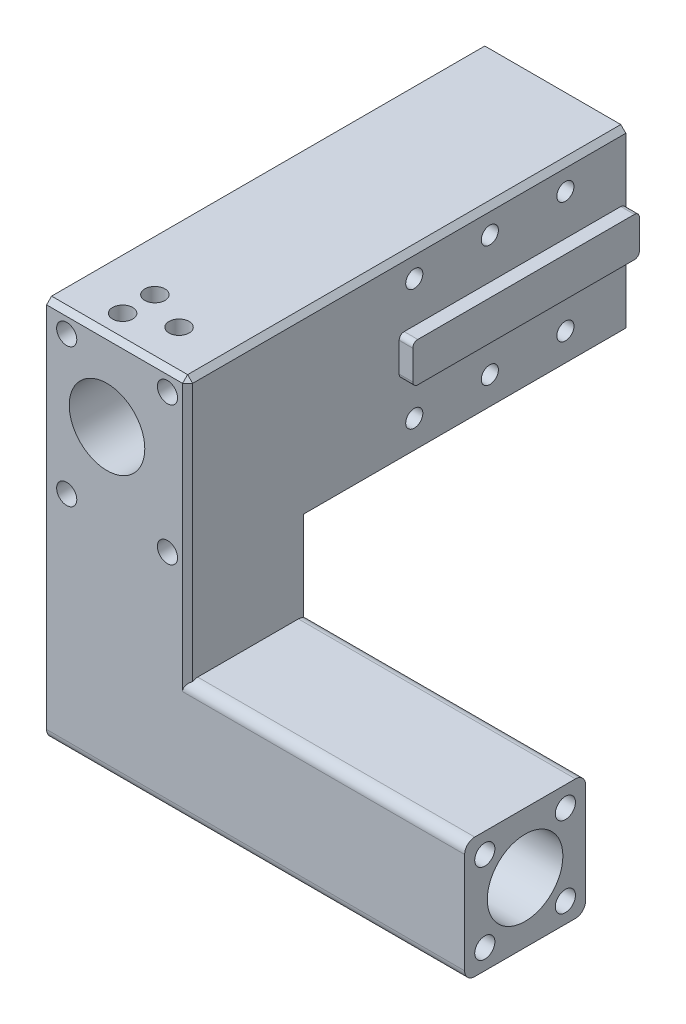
ISO-10303-21;
HEADER;
FILE_DESCRIPTION(('STEP AP214'),'2;1');
FILE_NAME('part.step','',(''),(''),'','','');
FILE_SCHEMA(('AUTOMOTIVE_DESIGN { 1 0 10303 214 1 1 1 1 }'));
ENDSEC;
DATA;
#1=APPLICATION_CONTEXT('core data for automotive mechanical design processes');
#2=APPLICATION_PROTOCOL_DEFINITION('international standard','automotive_design',2000,#1);
#3=PRODUCT_CONTEXT('',#1,'mechanical');
#4=PRODUCT('Part','Part','',(#3));
#5=PRODUCT_RELATED_PRODUCT_CATEGORY('part','',(#4));
#6=PRODUCT_DEFINITION_FORMATION('','',#4);
#7=PRODUCT_DEFINITION_CONTEXT('part definition',#1,'design');
#8=PRODUCT_DEFINITION('design','',#6,#7);
#9=PRODUCT_DEFINITION_SHAPE('','',#8);
#10=(LENGTH_UNIT() NAMED_UNIT(*) SI_UNIT(.MILLI.,.METRE.));
#11=(NAMED_UNIT(*) PLANE_ANGLE_UNIT() SI_UNIT($,.RADIAN.));
#12=(NAMED_UNIT(*) SI_UNIT($,.STERADIAN.) SOLID_ANGLE_UNIT());
#13=UNCERTAINTY_MEASURE_WITH_UNIT(LENGTH_MEASURE(1.E-05),#10,'distance_accuracy_value','');
#14=(GEOMETRIC_REPRESENTATION_CONTEXT(3) GLOBAL_UNCERTAINTY_ASSIGNED_CONTEXT((#13)) GLOBAL_UNIT_ASSIGNED_CONTEXT((#10,
#11,#12)) REPRESENTATION_CONTEXT('',''));
#15=CARTESIAN_POINT('',(0.,0.,0.));
#16=DIRECTION('',(0.,0.,1.));
#17=DIRECTION('',(1.,0.,0.));
#18=AXIS2_PLACEMENT_3D('',#15,#16,#17);
#19=CARTESIAN_POINT('',(14.,50.25,43.5));
#20=DIRECTION('',(-1.,0.,0.));
#21=DIRECTION('',(0.,0.,1.));
#22=AXIS2_PLACEMENT_3D('',#19,#20,#21);
#23=PLANE('',#22);
#24=CARTESIAN_POINT('',(14.,-3.25,-31.5));
#25=DIRECTION('',(-1.,0.,0.));
#26=DIRECTION('',(0.,0.,1.));
#27=AXIS2_PLACEMENT_3D('',#24,#25,#26);
#28=CIRCLE('',#27,1.69999999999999);
#29=CARTESIAN_POINT('',(14.,-3.25,-29.8));
#30=VERTEX_POINT('',#29);
#31=EDGE_CURVE('E498',#30,#30,#28,.T.);
#32=ORIENTED_EDGE('',*,*,#31,.T.);
#33=EDGE_LOOP('',(#32));
#34=FACE_BOUND('',#33,.T.);
#35=CARTESIAN_POINT('',(14.,20.75,-31.5));
#36=DIRECTION('',(-1.,0.,0.));
#37=DIRECTION('',(0.,0.,1.));
#38=AXIS2_PLACEMENT_3D('',#35,#36,#37);
#39=CIRCLE('',#38,1.69999999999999);
#40=CARTESIAN_POINT('',(14.,20.75,-29.8));
#41=VERTEX_POINT('',#40);
#42=EDGE_CURVE('E510',#41,#41,#39,.T.);
#43=ORIENTED_EDGE('',*,*,#42,.T.);
#44=EDGE_LOOP('',(#43));
#45=FACE_BOUND('',#44,.T.);
#46=CARTESIAN_POINT('',(14.,20.75,-16.5));
#47=DIRECTION('',(-1.,0.,0.));
#48=DIRECTION('',(0.,0.,1.));
#49=AXIS2_PLACEMENT_3D('',#46,#47,#48);
#50=CIRCLE('',#49,1.69999999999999);
#51=CARTESIAN_POINT('',(14.,20.75,-14.8));
#52=VERTEX_POINT('',#51);
#53=EDGE_CURVE('E522',#52,#52,#50,.T.);
#54=ORIENTED_EDGE('',*,*,#53,.T.);
#55=EDGE_LOOP('',(#54));
#56=FACE_BOUND('',#55,.T.);
#57=CARTESIAN_POINT('',(14.,-3.25,-16.5));
#58=DIRECTION('',(-1.,0.,0.));
#59=DIRECTION('',(0.,0.,1.));
#60=AXIS2_PLACEMENT_3D('',#57,#58,#59);
#61=CIRCLE('',#60,1.69999999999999);
#62=CARTESIAN_POINT('',(14.,-3.25,-14.8));
#63=VERTEX_POINT('',#62);
#64=EDGE_CURVE('E534',#63,#63,#61,.T.);
#65=ORIENTED_EDGE('',*,*,#64,.T.);
#66=EDGE_LOOP('',(#65));
#67=FACE_BOUND('',#66,.T.);
#68=CARTESIAN_POINT('',(14.,-3.25,-1.5));
#69=DIRECTION('',(-1.,0.,0.));
#70=DIRECTION('',(0.,0.,1.));
#71=AXIS2_PLACEMENT_3D('',#68,#69,#70);
#72=CIRCLE('',#71,1.69999999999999);
#73=CARTESIAN_POINT('',(14.,-3.25,0.199999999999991));
#74=VERTEX_POINT('',#73);
#75=EDGE_CURVE('E546',#74,#74,#72,.T.);
#76=ORIENTED_EDGE('',*,*,#75,.T.);
#77=EDGE_LOOP('',(#76));
#78=FACE_BOUND('',#77,.T.);
#79=CARTESIAN_POINT('',(14.,20.75,-1.5));
#80=DIRECTION('',(-1.,0.,0.));
#81=DIRECTION('',(0.,0.,1.));
#82=AXIS2_PLACEMENT_3D('',#79,#80,#81);
#83=CIRCLE('',#82,1.69999999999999);
#84=CARTESIAN_POINT('',(14.,20.75,0.199999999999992));
#85=VERTEX_POINT('',#84);
#86=EDGE_CURVE('E558',#85,#85,#83,.T.);
#87=ORIENTED_EDGE('',*,*,#86,.T.);
#88=EDGE_LOOP('',(#87));
#89=FACE_BOUND('',#88,.T.);
#90=DIRECTION('',(0.,0.,1.));
#91=VECTOR('',#90,1.);
#92=CARTESIAN_POINT('',(14.,24.75,43.5));
#93=LINE('',#92,#91);
#94=CARTESIAN_POINT('',(14.,24.75,-43.5));
#95=VERTEX_POINT('',#94);
#96=CARTESIAN_POINT('',(14.,24.75,42.5));
#97=VERTEX_POINT('',#96);
#98=EDGE_CURVE('E333',#95,#97,#93,.T.);
#99=ORIENTED_EDGE('',*,*,#98,.T.);
#100=DIRECTION('',(0.,-1.,0.));
#101=VECTOR('',#100,1.);
#102=CARTESIAN_POINT('',(14.,50.25,42.5));
#103=LINE('',#102,#101);
#104=CARTESIAN_POINT('',(14.,-26.5179491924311,42.5));
#105=VERTEX_POINT('',#104);
#106=EDGE_CURVE('E335',#97,#105,#103,.T.);
#107=ORIENTED_EDGE('',*,*,#106,.T.);
#108=CARTESIAN_POINT('',(14.,-28.25,41.5));
#109=DIRECTION('',(-1.,0.,0.));
#110=DIRECTION('',(0.,0.,1.));
#111=AXIS2_PLACEMENT_3D('',#108,#109,#110);
#112=CIRCLE('',#111,2.);
#113=CARTESIAN_POINT('',(14.,-26.25,41.5));
#114=VERTEX_POINT('',#113);
#115=EDGE_CURVE('E316',#105,#114,#112,.T.);
#116=ORIENTED_EDGE('',*,*,#115,.T.);
#117=DIRECTION('',(0.,0.,1.));
#118=VECTOR('',#117,1.);
#119=CARTESIAN_POINT('',(14.,-26.25,43.5));
#120=LINE('',#119,#118);
#121=CARTESIAN_POINT('',(14.,-26.25,21.5));
#122=VERTEX_POINT('',#121);
#123=EDGE_CURVE('E474',#122,#114,#120,.T.);
#124=ORIENTED_EDGE('',*,*,#123,.F.);
#125=CARTESIAN_POINT('',(14.,-28.25,21.5));
#126=DIRECTION('',(-1.,0.,0.));
#127=DIRECTION('',(0.,0.,1.));
#128=AXIS2_PLACEMENT_3D('',#125,#126,#127);
#129=CIRCLE('',#128,2.);
#130=CARTESIAN_POINT('',(14.,-26.5179491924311,20.5));
#131=VERTEX_POINT('',#130);
#132=EDGE_CURVE('E313',#122,#131,#129,.T.);
#133=ORIENTED_EDGE('',*,*,#132,.T.);
#134=DIRECTION('',(0.,1.,0.));
#135=VECTOR('',#134,1.);
#136=CARTESIAN_POINT('',(14.,50.25,20.5));
#137=LINE('',#136,#135);
#138=CARTESIAN_POINT('',(14.,-8.75000000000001,20.5));
#139=VERTEX_POINT('',#138);
#140=EDGE_CURVE('E329',#131,#139,#137,.T.);
#141=ORIENTED_EDGE('',*,*,#140,.T.);
#142=DIRECTION('',(0.,0.,-1.));
#143=VECTOR('',#142,1.);
#144=CARTESIAN_POINT('',(14.,-8.75000000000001,43.5));
#145=LINE('',#144,#143);
#146=CARTESIAN_POINT('',(14.,-8.75,-43.5));
#147=VERTEX_POINT('',#146);
#148=EDGE_CURVE('E331',#139,#147,#145,.T.);
#149=ORIENTED_EDGE('',*,*,#148,.T.);
#150=DIRECTION('',(0.,-1.,0.));
#151=VECTOR('',#150,1.);
#152=CARTESIAN_POINT('',(14.,50.25,-43.5));
#153=LINE('',#152,#151);
#154=CARTESIAN_POINT('',(14.,5.85,-43.5));
#155=VERTEX_POINT('',#154);
#156=EDGE_CURVE('E235',#155,#147,#153,.T.);
#157=ORIENTED_EDGE('',*,*,#156,.F.);
#158=CARTESIAN_POINT('',(14.,5.85,-42.5));
#159=DIRECTION('',(-1.,0.,0.));
#160=DIRECTION('',(0.,0.,1.));
#161=AXIS2_PLACEMENT_3D('',#158,#159,#160);
#162=CIRCLE('',#161,1.);
#163=CARTESIAN_POINT('',(14.,4.85,-42.5));
#164=VERTEX_POINT('',#163);
#165=EDGE_CURVE('E275',#155,#164,#162,.T.);
#166=ORIENTED_EDGE('',*,*,#165,.T.);
#167=DIRECTION('',(0.,0.,-1.));
#168=VECTOR('',#167,1.);
#169=CARTESIAN_POINT('',(14.,4.85,1.49999999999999));
#170=LINE('',#169,#168);
#171=CARTESIAN_POINT('',(14.,4.85,0.499999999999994));
#172=VERTEX_POINT('',#171);
#173=EDGE_CURVE('E359',#172,#164,#170,.T.);
#174=ORIENTED_EDGE('',*,*,#173,.F.);
#175=CARTESIAN_POINT('',(14.,5.85,0.499999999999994));
#176=DIRECTION('',(-1.,0.,0.));
#177=DIRECTION('',(0.,0.,1.));
#178=AXIS2_PLACEMENT_3D('',#175,#176,#177);
#179=CIRCLE('',#178,1.);
#180=CARTESIAN_POINT('',(14.,5.85,1.49999999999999));
#181=VERTEX_POINT('',#180);
#182=EDGE_CURVE('E279',#172,#181,#179,.T.);
#183=ORIENTED_EDGE('',*,*,#182,.T.);
#184=DIRECTION('',(0.,-1.,0.));
#185=VECTOR('',#184,1.);
#186=CARTESIAN_POINT('',(14.,12.65,1.49999999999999));
#187=LINE('',#186,#185);
#188=CARTESIAN_POINT('',(14.,11.65,1.49999999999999));
#189=VERTEX_POINT('',#188);
#190=EDGE_CURVE('E353',#189,#181,#187,.T.);
#191=ORIENTED_EDGE('',*,*,#190,.F.);
#192=CARTESIAN_POINT('',(14.,11.65,0.499999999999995));
#193=DIRECTION('',(-1.,0.,0.));
#194=DIRECTION('',(0.,0.,1.));
#195=AXIS2_PLACEMENT_3D('',#192,#193,#194);
#196=CIRCLE('',#195,1.);
#197=CARTESIAN_POINT('',(14.,12.65,0.499999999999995));
#198=VERTEX_POINT('',#197);
#199=EDGE_CURVE('E277',#189,#198,#196,.T.);
#200=ORIENTED_EDGE('',*,*,#199,.T.);
#201=DIRECTION('',(0.,0.,1.));
#202=VECTOR('',#201,1.);
#203=CARTESIAN_POINT('',(14.,12.65,1.49999999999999));
#204=LINE('',#203,#202);
#205=CARTESIAN_POINT('',(14.,12.65,-42.5));
#206=VERTEX_POINT('',#205);
#207=EDGE_CURVE('E365',#206,#198,#204,.T.);
#208=ORIENTED_EDGE('',*,*,#207,.F.);
#209=CARTESIAN_POINT('',(14.,11.65,-42.5));
#210=DIRECTION('',(-1.,0.,0.));
#211=DIRECTION('',(0.,0.,1.));
#212=AXIS2_PLACEMENT_3D('',#209,#210,#211);
#213=CIRCLE('',#212,1.);
#214=CARTESIAN_POINT('',(14.,11.65,-43.5));
#215=VERTEX_POINT('',#214);
#216=EDGE_CURVE('E272',#206,#215,#213,.T.);
#217=ORIENTED_EDGE('',*,*,#216,.T.);
#218=EDGE_CURVE('E238',#95,#215,#153,.T.);
#219=ORIENTED_EDGE('',*,*,#218,.F.);
#220=EDGE_LOOP('',(#99,#107,#116,#124,#133,#141,#149,#157,#166,#174,#183,#191,#200,#208,#217,#219));
#221=FACE_BOUND('',#220,.T.);
#222=ADVANCED_FACE('F43',(#34,#45,#56,#67,#78,#89,#221),#23,.F.);
#223=CARTESIAN_POINT('',(-14.,50.25,-43.5));
#224=DIRECTION('',(0.,0.,1.));
#225=DIRECTION('',(1.,0.,0.));
#226=AXIS2_PLACEMENT_3D('',#223,#224,#225);
#227=PLANE('',#226);
#228=CARTESIAN_POINT('',(10.,21.75,-43.5));
#229=DIRECTION('',(0.,0.,-1.));
#230=DIRECTION('',(-1.,0.,0.));
#231=AXIS2_PLACEMENT_3D('',#228,#229,#230);
#232=CIRCLE('',#231,1.99999999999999);
#233=CARTESIAN_POINT('',(8.00000000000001,21.75,-43.5));
#234=VERTEX_POINT('',#233);
#235=EDGE_CURVE('E399',#234,#234,#232,.T.);
#236=ORIENTED_EDGE('',*,*,#235,.F.);
#237=EDGE_LOOP('',(#236));
#238=FACE_BOUND('',#237,.T.);
#239=CARTESIAN_POINT('',(-10.,21.75,-43.5));
#240=DIRECTION('',(0.,0.,-1.));
#241=DIRECTION('',(-1.,0.,0.));
#242=AXIS2_PLACEMENT_3D('',#239,#240,#241);
#243=CIRCLE('',#242,1.99999999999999);
#244=CARTESIAN_POINT('',(-12.,21.75,-43.5));
#245=VERTEX_POINT('',#244);
#246=EDGE_CURVE('E405',#245,#245,#243,.T.);
#247=ORIENTED_EDGE('',*,*,#246,.F.);
#248=EDGE_LOOP('',(#247));
#249=FACE_BOUND('',#248,.T.);
#250=CARTESIAN_POINT('',(-10.,-5.75,-43.5));
#251=DIRECTION('',(0.,0.,-1.));
#252=DIRECTION('',(-1.,0.,0.));
#253=AXIS2_PLACEMENT_3D('',#250,#251,#252);
#254=CIRCLE('',#253,1.99999999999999);
#255=CARTESIAN_POINT('',(-12.,-5.75,-43.5));
#256=VERTEX_POINT('',#255);
#257=EDGE_CURVE('E411',#256,#256,#254,.T.);
#258=ORIENTED_EDGE('',*,*,#257,.F.);
#259=EDGE_LOOP('',(#258));
#260=FACE_BOUND('',#259,.T.);
#261=CARTESIAN_POINT('',(10.,-5.75,-43.5));
#262=DIRECTION('',(0.,0.,-1.));
#263=DIRECTION('',(-1.,0.,0.));
#264=AXIS2_PLACEMENT_3D('',#261,#262,#263);
#265=CIRCLE('',#264,1.99999999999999);
#266=CARTESIAN_POINT('',(8.00000000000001,-5.75,-43.5));
#267=VERTEX_POINT('',#266);
#268=EDGE_CURVE('E417',#267,#267,#265,.T.);
#269=ORIENTED_EDGE('',*,*,#268,.F.);
#270=EDGE_LOOP('',(#269));
#271=FACE_BOUND('',#270,.T.);
#272=CARTESIAN_POINT('',(-2.,9.74999999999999,-43.5));
#273=DIRECTION('',(0.,0.,1.));
#274=DIRECTION('',(1.,0.,0.));
#275=AXIS2_PLACEMENT_3D('',#272,#273,#274);
#276=CIRCLE('',#275,7.49999999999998);
#277=CARTESIAN_POINT('',(5.49999999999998,9.74999999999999,-43.5));
#278=VERTEX_POINT('',#277);
#279=EDGE_CURVE('E569',#278,#278,#276,.T.);
#280=ORIENTED_EDGE('',*,*,#279,.T.);
#281=EDGE_LOOP('',(#280));
#282=FACE_BOUND('',#281,.T.);
#283=DIRECTION('',(1.,0.,0.));
#284=VECTOR('',#283,1.);
#285=CARTESIAN_POINT('',(-14.,25.75,-43.5));
#286=LINE('',#285,#284);
#287=CARTESIAN_POINT('',(-14.,25.75,-43.5));
#288=VERTEX_POINT('',#287);
#289=CARTESIAN_POINT('',(13.,25.75,-43.5));
#290=VERTEX_POINT('',#289);
#291=EDGE_CURVE('E219',#288,#290,#286,.T.);
#292=ORIENTED_EDGE('',*,*,#291,.T.);
#293=DIRECTION('',(-0.707106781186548,0.707106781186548,0.));
#294=VECTOR('',#293,1.);
#295=CARTESIAN_POINT('',(13.,25.75,-43.5));
#296=LINE('',#295,#294);
#297=EDGE_CURVE('E338',#290,#95,#296,.F.);
#298=ORIENTED_EDGE('',*,*,#297,.T.);
#299=ORIENTED_EDGE('',*,*,#218,.T.);
#300=DIRECTION('',(-1.,0.,0.));
#301=VECTOR('',#300,1.);
#302=CARTESIAN_POINT('',(-14.,11.65,-43.5));
#303=LINE('',#302,#301);
#304=CARTESIAN_POINT('',(16.7,11.65,-43.5));
#305=VERTEX_POINT('',#304);
#306=EDGE_CURVE('E252',#215,#305,#303,.F.);
#307=ORIENTED_EDGE('',*,*,#306,.T.);
#308=DIRECTION('',(0.,1.,0.));
#309=VECTOR('',#308,1.);
#310=CARTESIAN_POINT('',(16.7,12.65,-43.5));
#311=LINE('',#310,#309);
#312=CARTESIAN_POINT('',(16.7,5.85,-43.5));
#313=VERTEX_POINT('',#312);
#314=EDGE_CURVE('E692',#313,#305,#311,.T.);
#315=ORIENTED_EDGE('',*,*,#314,.F.);
#316=DIRECTION('',(-1.,0.,0.));
#317=VECTOR('',#316,1.);
#318=CARTESIAN_POINT('',(-14.,5.85,-43.5));
#319=LINE('',#318,#317);
#320=EDGE_CURVE('E249',#313,#155,#319,.T.);
#321=ORIENTED_EDGE('',*,*,#320,.T.);
#322=ORIENTED_EDGE('',*,*,#156,.T.);
#323=DIRECTION('',(0.707106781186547,0.707106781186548,0.));
#324=VECTOR('',#323,1.);
#325=CARTESIAN_POINT('',(13.,-9.75,-43.5));
#326=LINE('',#325,#324);
#327=CARTESIAN_POINT('',(13.,-9.75,-43.5));
#328=VERTEX_POINT('',#327);
#329=EDGE_CURVE('E228',#147,#328,#326,.F.);
#330=ORIENTED_EDGE('',*,*,#329,.T.);
#331=DIRECTION('',(1.,0.,0.));
#332=VECTOR('',#331,1.);
#333=CARTESIAN_POINT('',(-14.,-9.75,-43.5));
#334=LINE('',#333,#332);
#335=CARTESIAN_POINT('',(-14.,-9.75,-43.5));
#336=VERTEX_POINT('',#335);
#337=EDGE_CURVE('E211',#336,#328,#334,.T.);
#338=ORIENTED_EDGE('',*,*,#337,.F.);
#339=DIRECTION('',(0.,-1.,0.));
#340=VECTOR('',#339,1.);
#341=CARTESIAN_POINT('',(-14.,50.25,-43.5));
#342=LINE('',#341,#340);
#343=EDGE_CURVE('E225',#288,#336,#342,.T.);
#344=ORIENTED_EDGE('',*,*,#343,.F.);
#345=EDGE_LOOP('',(#292,#298,#299,#307,#315,#321,#322,#330,#338,#344));
#346=FACE_BOUND('',#345,.T.);
#347=ADVANCED_FACE('F224',(#238,#249,#260,#271,#282,#346),#227,.F.);
#348=CARTESIAN_POINT('',(-14.,50.25,43.5));
#349=DIRECTION('',(1.,0.,0.));
#350=DIRECTION('',(0.,0.,-1.));
#351=AXIS2_PLACEMENT_3D('',#348,#349,#350);
#352=PLANE('',#351);
#353=CARTESIAN_POINT('',(-14.,-30.25,39.5));
#354=DIRECTION('',(-1.,0.,0.));
#355=DIRECTION('',(0.,0.,1.));
#356=AXIS2_PLACEMENT_3D('',#353,#354,#355);
#357=CIRCLE('',#356,1.99999999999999);
#358=CARTESIAN_POINT('',(-14.,-30.25,41.5));
#359=VERTEX_POINT('',#358);
#360=EDGE_CURVE('E423',#359,#359,#357,.T.);
#361=ORIENTED_EDGE('',*,*,#360,.F.);
#362=EDGE_LOOP('',(#361));
#363=FACE_BOUND('',#362,.T.);
#364=CARTESIAN_POINT('',(-14.,-30.25,23.5));
#365=DIRECTION('',(-1.,0.,0.));
#366=DIRECTION('',(0.,0.,1.));
#367=AXIS2_PLACEMENT_3D('',#364,#365,#366);
#368=CIRCLE('',#367,1.99999999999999);
#369=CARTESIAN_POINT('',(-14.,-30.25,25.5));
#370=VERTEX_POINT('',#369);
#371=EDGE_CURVE('E429',#370,#370,#368,.T.);
#372=ORIENTED_EDGE('',*,*,#371,.F.);
#373=EDGE_LOOP('',(#372));
#374=FACE_BOUND('',#373,.T.);
#375=CARTESIAN_POINT('',(-14.,-46.25,23.5));
#376=DIRECTION('',(-1.,0.,0.));
#377=DIRECTION('',(0.,0.,1.));
#378=AXIS2_PLACEMENT_3D('',#375,#376,#377);
#379=CIRCLE('',#378,1.99999999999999);
#380=CARTESIAN_POINT('',(-14.,-46.25,25.5));
#381=VERTEX_POINT('',#380);
#382=EDGE_CURVE('E435',#381,#381,#379,.T.);
#383=ORIENTED_EDGE('',*,*,#382,.F.);
#384=EDGE_LOOP('',(#383));
#385=FACE_BOUND('',#384,.T.);
#386=CARTESIAN_POINT('',(-14.,-46.25,39.5));
#387=DIRECTION('',(-1.,0.,0.));
#388=DIRECTION('',(0.,0.,1.));
#389=AXIS2_PLACEMENT_3D('',#386,#387,#388);
#390=CIRCLE('',#389,1.99999999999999);
#391=CARTESIAN_POINT('',(-14.,-46.25,41.5));
#392=VERTEX_POINT('',#391);
#393=EDGE_CURVE('E441',#392,#392,#390,.T.);
#394=ORIENTED_EDGE('',*,*,#393,.F.);
#395=EDGE_LOOP('',(#394));
#396=FACE_BOUND('',#395,.T.);
#397=CARTESIAN_POINT('',(-14.,-3.25,-31.5));
#398=DIRECTION('',(-1.,0.,0.));
#399=DIRECTION('',(0.,0.,1.));
#400=AXIS2_PLACEMENT_3D('',#397,#398,#399);
#401=CIRCLE('',#400,3.25);
#402=CARTESIAN_POINT('',(-14.,-3.25,-28.25));
#403=VERTEX_POINT('',#402);
#404=EDGE_CURVE('E487',#403,#403,#401,.T.);
#405=ORIENTED_EDGE('',*,*,#404,.F.);
#406=EDGE_LOOP('',(#405));
#407=FACE_BOUND('',#406,.T.);
#408=CARTESIAN_POINT('',(-14.,20.75,-31.5));
#409=DIRECTION('',(-1.,0.,0.));
#410=DIRECTION('',(0.,0.,1.));
#411=AXIS2_PLACEMENT_3D('',#408,#409,#410);
#412=CIRCLE('',#411,3.25);
#413=CARTESIAN_POINT('',(-14.,20.75,-28.25));
#414=VERTEX_POINT('',#413);
#415=EDGE_CURVE('E501',#414,#414,#412,.T.);
#416=ORIENTED_EDGE('',*,*,#415,.F.);
#417=EDGE_LOOP('',(#416));
#418=FACE_BOUND('',#417,.T.);
#419=CARTESIAN_POINT('',(-14.,20.75,-16.5));
#420=DIRECTION('',(-1.,0.,0.));
#421=DIRECTION('',(0.,0.,1.));
#422=AXIS2_PLACEMENT_3D('',#419,#420,#421);
#423=CIRCLE('',#422,3.25);
#424=CARTESIAN_POINT('',(-14.,20.75,-13.25));
#425=VERTEX_POINT('',#424);
#426=EDGE_CURVE('E513',#425,#425,#423,.T.);
#427=ORIENTED_EDGE('',*,*,#426,.F.);
#428=EDGE_LOOP('',(#427));
#429=FACE_BOUND('',#428,.T.);
#430=CARTESIAN_POINT('',(-14.,-3.25,-16.5));
#431=DIRECTION('',(-1.,0.,0.));
#432=DIRECTION('',(0.,0.,1.));
#433=AXIS2_PLACEMENT_3D('',#430,#431,#432);
#434=CIRCLE('',#433,3.25);
#435=CARTESIAN_POINT('',(-14.,-3.25,-13.25));
#436=VERTEX_POINT('',#435);
#437=EDGE_CURVE('E525',#436,#436,#434,.T.);
#438=ORIENTED_EDGE('',*,*,#437,.F.);
#439=EDGE_LOOP('',(#438));
#440=FACE_BOUND('',#439,.T.);
#441=CARTESIAN_POINT('',(-14.,-3.25,-1.5));
#442=DIRECTION('',(-1.,0.,0.));
#443=DIRECTION('',(0.,0.,1.));
#444=AXIS2_PLACEMENT_3D('',#441,#442,#443);
#445=CIRCLE('',#444,3.25);
#446=CARTESIAN_POINT('',(-14.,-3.25,1.74999999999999));
#447=VERTEX_POINT('',#446);
#448=EDGE_CURVE('E537',#447,#447,#445,.T.);
#449=ORIENTED_EDGE('',*,*,#448,.F.);
#450=EDGE_LOOP('',(#449));
#451=FACE_BOUND('',#450,.T.);
#452=CARTESIAN_POINT('',(-14.,20.75,-1.5));
#453=DIRECTION('',(-1.,0.,0.));
#454=DIRECTION('',(0.,0.,1.));
#455=AXIS2_PLACEMENT_3D('',#452,#453,#454);
#456=CIRCLE('',#455,3.25);
#457=CARTESIAN_POINT('',(-14.,20.75,1.74999999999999));
#458=VERTEX_POINT('',#457);
#459=EDGE_CURVE('E549',#458,#458,#456,.T.);
#460=ORIENTED_EDGE('',*,*,#459,.F.);
#461=EDGE_LOOP('',(#460));
#462=FACE_BOUND('',#461,.T.);
#463=CARTESIAN_POINT('',(-14.,-38.25,31.5));
#464=DIRECTION('',(1.,0.,0.));
#465=DIRECTION('',(0.,0.,-1.));
#466=AXIS2_PLACEMENT_3D('',#463,#464,#465);
#467=CIRCLE('',#466,7.49999999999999);
#468=CARTESIAN_POINT('',(-14.,-38.25,24.));
#469=VERTEX_POINT('',#468);
#470=EDGE_CURVE('E572',#469,#469,#467,.T.);
#471=ORIENTED_EDGE('',*,*,#470,.T.);
#472=EDGE_LOOP('',(#471));
#473=FACE_BOUND('',#472,.T.);
#474=DIRECTION('',(0.,-1.,0.));
#475=VECTOR('',#474,1.);
#476=CARTESIAN_POINT('',(-14.,50.25,43.5));
#477=LINE('',#476,#475);
#478=CARTESIAN_POINT('',(-14.,24.75,43.5));
#479=VERTEX_POINT('',#478);
#480=CARTESIAN_POINT('',(-14.,-48.25,43.5));
#481=VERTEX_POINT('',#480);
#482=EDGE_CURVE('E236',#479,#481,#477,.T.);
#483=ORIENTED_EDGE('',*,*,#482,.F.);
#484=DIRECTION('',(0.,-0.707106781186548,0.707106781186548));
#485=VECTOR('',#484,1.);
#486=CARTESIAN_POINT('',(-14.,25.75,42.5));
#487=LINE('',#486,#485);
#488=CARTESIAN_POINT('',(-14.,25.75,42.5));
#489=VERTEX_POINT('',#488);
#490=EDGE_CURVE('E327',#479,#489,#487,.F.);
#491=ORIENTED_EDGE('',*,*,#490,.T.);
#492=DIRECTION('',(0.,0.,-1.));
#493=VECTOR('',#492,1.);
#494=CARTESIAN_POINT('',(-14.,25.75,35.5));
#495=LINE('',#494,#493);
#496=EDGE_CURVE('E233',#489,#288,#495,.T.);
#497=ORIENTED_EDGE('',*,*,#496,.T.);
#498=ORIENTED_EDGE('',*,*,#343,.T.);
#499=DIRECTION('',(0.,0.,1.));
#500=VECTOR('',#499,1.);
#501=CARTESIAN_POINT('',(-14.,-9.75,-43.5));
#502=LINE('',#501,#500);
#503=CARTESIAN_POINT('',(-14.,-9.75000000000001,19.5));
#504=VERTEX_POINT('',#503);
#505=EDGE_CURVE('E207',#336,#504,#502,.T.);
#506=ORIENTED_EDGE('',*,*,#505,.T.);
#507=DIRECTION('',(0.,-1.,0.));
#508=VECTOR('',#507,1.);
#509=CARTESIAN_POINT('',(-14.,-9.75000000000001,19.5));
#510=LINE('',#509,#508);
#511=CARTESIAN_POINT('',(-14.,-48.25,19.5));
#512=VERTEX_POINT('',#511);
#513=EDGE_CURVE('E218',#504,#512,#510,.T.);
#514=ORIENTED_EDGE('',*,*,#513,.T.);
#515=CARTESIAN_POINT('',(-14.,-48.25,21.5));
#516=DIRECTION('',(1.,0.,0.));
#517=DIRECTION('',(0.,0.,-1.));
#518=AXIS2_PLACEMENT_3D('',#515,#516,#517);
#519=CIRCLE('',#518,2.);
#520=CARTESIAN_POINT('',(-14.,-50.25,21.5));
#521=VERTEX_POINT('',#520);
#522=EDGE_CURVE('E299',#512,#521,#519,.F.);
#523=ORIENTED_EDGE('',*,*,#522,.T.);
#524=DIRECTION('',(0.,0.,1.));
#525=VECTOR('',#524,1.);
#526=CARTESIAN_POINT('',(-14.,-50.25,43.5));
#527=LINE('',#526,#525);
#528=CARTESIAN_POINT('',(-14.,-50.25,41.5));
#529=VERTEX_POINT('',#528);
#530=EDGE_CURVE('E240',#521,#529,#527,.T.);
#531=ORIENTED_EDGE('',*,*,#530,.T.);
#532=CARTESIAN_POINT('',(-14.,-48.25,41.5));
#533=DIRECTION('',(1.,0.,0.));
#534=DIRECTION('',(0.,0.,-1.));
#535=AXIS2_PLACEMENT_3D('',#532,#533,#534);
#536=CIRCLE('',#535,2.);
#537=EDGE_CURVE('E301',#529,#481,#536,.F.);
#538=ORIENTED_EDGE('',*,*,#537,.T.);
#539=EDGE_LOOP('',(#483,#491,#497,#498,#506,#514,#523,#531,#538));
#540=FACE_BOUND('',#539,.T.);
#541=ADVANCED_FACE('F231',(#363,#374,#385,#396,#407,#418,#429,#440,#451,#462,#473,#540),#352,.F.);
#542=CARTESIAN_POINT('',(-14.,50.25,43.5));
#543=DIRECTION('',(0.,0.,-1.));
#544=DIRECTION('',(-1.,0.,0.));
#545=AXIS2_PLACEMENT_3D('',#542,#543,#544);
#546=PLANE('',#545);
#547=CARTESIAN_POINT('',(10.,21.75,43.5));
#548=DIRECTION('',(0.,0.,1.));
#549=DIRECTION('',(1.,0.,0.));
#550=AXIS2_PLACEMENT_3D('',#547,#548,#549);
#551=CIRCLE('',#550,1.99999999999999);
#552=CARTESIAN_POINT('',(12.,21.75,43.5));
#553=VERTEX_POINT('',#552);
#554=EDGE_CURVE('E374',#553,#553,#551,.T.);
#555=ORIENTED_EDGE('',*,*,#554,.F.);
#556=EDGE_LOOP('',(#555));
#557=FACE_BOUND('',#556,.T.);
#558=CARTESIAN_POINT('',(-10.,21.75,43.5));
#559=DIRECTION('',(0.,0.,1.));
#560=DIRECTION('',(1.,0.,0.));
#561=AXIS2_PLACEMENT_3D('',#558,#559,#560);
#562=CIRCLE('',#561,1.99999999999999);
#563=CARTESIAN_POINT('',(-8.00000000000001,21.75,43.5));
#564=VERTEX_POINT('',#563);
#565=EDGE_CURVE('E380',#564,#564,#562,.T.);
#566=ORIENTED_EDGE('',*,*,#565,.F.);
#567=EDGE_LOOP('',(#566));
#568=FACE_BOUND('',#567,.T.);
#569=CARTESIAN_POINT('',(-10.,-5.75,43.5));
#570=DIRECTION('',(0.,0.,1.));
#571=DIRECTION('',(1.,0.,0.));
#572=AXIS2_PLACEMENT_3D('',#569,#570,#571);
#573=CIRCLE('',#572,1.99999999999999);
#574=CARTESIAN_POINT('',(-8.00000000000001,-5.75,43.5));
#575=VERTEX_POINT('',#574);
#576=EDGE_CURVE('E386',#575,#575,#573,.T.);
#577=ORIENTED_EDGE('',*,*,#576,.F.);
#578=EDGE_LOOP('',(#577));
#579=FACE_BOUND('',#578,.T.);
#580=CARTESIAN_POINT('',(10.,-5.75,43.5));
#581=DIRECTION('',(0.,0.,1.));
#582=DIRECTION('',(1.,0.,0.));
#583=AXIS2_PLACEMENT_3D('',#580,#581,#582);
#584=CIRCLE('',#583,1.99999999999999);
#585=CARTESIAN_POINT('',(12.,-5.75,43.5));
#586=VERTEX_POINT('',#585);
#587=EDGE_CURVE('E392',#586,#586,#584,.T.);
#588=ORIENTED_EDGE('',*,*,#587,.F.);
#589=EDGE_LOOP('',(#588));
#590=FACE_BOUND('',#589,.T.);
#591=CARTESIAN_POINT('',(-2.,9.74999999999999,43.5));
#592=DIRECTION('',(0.,0.,1.));
#593=DIRECTION('',(1.,0.,0.));
#594=AXIS2_PLACEMENT_3D('',#591,#592,#593);
#595=CIRCLE('',#594,7.5);
#596=CARTESIAN_POINT('',(5.5,9.74999999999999,43.5));
#597=VERTEX_POINT('',#596);
#598=EDGE_CURVE('E562',#597,#597,#595,.T.);
#599=ORIENTED_EDGE('',*,*,#598,.F.);
#600=EDGE_LOOP('',(#599));
#601=FACE_BOUND('',#600,.T.);
#602=DIRECTION('',(0.,1.,0.));
#603=VECTOR('',#602,1.);
#604=CARTESIAN_POINT('',(13.,50.25,43.5));
#605=LINE('',#604,#603);
#606=CARTESIAN_POINT('',(13.,-28.25,43.5));
#607=VERTEX_POINT('',#606);
#608=CARTESIAN_POINT('',(13.,24.75,43.5));
#609=VERTEX_POINT('',#608);
#610=EDGE_CURVE('E323',#607,#609,#605,.T.);
#611=ORIENTED_EDGE('',*,*,#610,.T.);
#612=DIRECTION('',(-1.,0.,0.));
#613=VECTOR('',#612,1.);
#614=CARTESIAN_POINT('',(-14.,24.75,43.5));
#615=LINE('',#614,#613);
#616=EDGE_CURVE('E325',#609,#479,#615,.T.);
#617=ORIENTED_EDGE('',*,*,#616,.T.);
#618=ORIENTED_EDGE('',*,*,#482,.T.);
#619=DIRECTION('',(1.,0.,0.));
#620=VECTOR('',#619,1.);
#621=CARTESIAN_POINT('',(69.,-48.25,43.5));
#622=LINE('',#621,#620);
#623=CARTESIAN_POINT('',(69.,-48.25,43.5));
#624=VERTEX_POINT('',#623);
#625=EDGE_CURVE('E283',#481,#624,#622,.T.);
#626=ORIENTED_EDGE('',*,*,#625,.T.);
#627=DIRECTION('',(0.,-1.,0.));
#628=VECTOR('',#627,1.);
#629=CARTESIAN_POINT('',(69.,-50.25,43.5));
#630=LINE('',#629,#628);
#631=CARTESIAN_POINT('',(69.,-28.25,43.5));
#632=VERTEX_POINT('',#631);
#633=EDGE_CURVE('E475',#632,#624,#630,.T.);
#634=ORIENTED_EDGE('',*,*,#633,.F.);
#635=DIRECTION('',(-1.,0.,0.));
#636=VECTOR('',#635,1.);
#637=CARTESIAN_POINT('',(-14.,-28.25,43.5));
#638=LINE('',#637,#636);
#639=EDGE_CURVE('E281',#632,#607,#638,.T.);
#640=ORIENTED_EDGE('',*,*,#639,.T.);
#641=EDGE_LOOP('',(#611,#617,#618,#626,#634,#640));
#642=FACE_BOUND('',#641,.T.);
#643=ADVANCED_FACE('F586',(#557,#568,#579,#590,#601,#642),#546,.F.);
#644=CARTESIAN_POINT('',(0.,-50.25,0.));
#645=DIRECTION('',(0.,-1.,0.));
#646=DIRECTION('',(0.,0.,-1.));
#647=AXIS2_PLACEMENT_3D('',#644,#645,#646);
#648=PLANE('',#647);
#649=DIRECTION('',(0.,0.,-1.));
#650=VECTOR('',#649,1.);
#651=CARTESIAN_POINT('',(69.,-50.25,43.5));
#652=LINE('',#651,#650);
#653=CARTESIAN_POINT('',(69.,-50.25,41.5));
#654=VERTEX_POINT('',#653);
#655=CARTESIAN_POINT('',(69.,-50.25,21.5));
#656=VERTEX_POINT('',#655);
#657=EDGE_CURVE('E478',#654,#656,#652,.T.);
#658=ORIENTED_EDGE('',*,*,#657,.F.);
#659=DIRECTION('',(1.,0.,0.));
#660=VECTOR('',#659,1.);
#661=CARTESIAN_POINT('',(-14.,-50.25,41.5));
#662=LINE('',#661,#660);
#663=EDGE_CURVE('E297',#654,#529,#662,.F.);
#664=ORIENTED_EDGE('',*,*,#663,.T.);
#665=ORIENTED_EDGE('',*,*,#530,.F.);
#666=DIRECTION('',(1.,0.,0.));
#667=VECTOR('',#666,1.);
#668=CARTESIAN_POINT('',(69.,-50.25,21.5));
#669=LINE('',#668,#667);
#670=EDGE_CURVE('E294',#521,#656,#669,.T.);
#671=ORIENTED_EDGE('',*,*,#670,.T.);
#672=EDGE_LOOP('',(#658,#664,#665,#671));
#673=FACE_BOUND('',#672,.T.);
#674=ADVANCED_FACE('F986',(#673),#648,.T.);
#675=CARTESIAN_POINT('',(14.,-38.25,31.5));
#676=DIRECTION('',(1.,0.,0.));
#677=DIRECTION('',(0.,0.,-1.));
#678=AXIS2_PLACEMENT_3D('',#675,#676,#677);
#679=CYLINDRICAL_SURFACE('',#678,7.49999999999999);
#680=ORIENTED_EDGE('',*,*,#470,.F.);
#681=EDGE_LOOP('',(#680));
#682=FACE_BOUND('',#681,.T.);
#683=CARTESIAN_POINT('',(69.,-38.25,31.5));
#684=DIRECTION('',(1.,0.,0.));
#685=DIRECTION('',(0.,0.,-1.));
#686=AXIS2_PLACEMENT_3D('',#683,#684,#685);
#687=CIRCLE('',#686,7.49999999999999);
#688=CARTESIAN_POINT('',(69.,-38.25,24.));
#689=VERTEX_POINT('',#688);
#690=EDGE_CURVE('E471',#689,#689,#687,.T.);
#691=ORIENTED_EDGE('',*,*,#690,.T.);
#692=EDGE_LOOP('',(#691));
#693=FACE_BOUND('',#692,.T.);
#694=ADVANCED_FACE('F982',(#682,#693),#679,.F.);
#695=CARTESIAN_POINT('',(-2.,9.74999999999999,43.5));
#696=DIRECTION('',(0.,0.,1.));
#697=DIRECTION('',(1.,0.,0.));
#698=AXIS2_PLACEMENT_3D('',#695,#696,#697);
#699=CYLINDRICAL_SURFACE('',#698,7.49999999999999);
#700=ORIENTED_EDGE('',*,*,#279,.F.);
#701=EDGE_LOOP('',(#700));
#702=FACE_BOUND('',#701,.T.);
#703=ORIENTED_EDGE('',*,*,#598,.T.);
#704=EDGE_LOOP('',(#703));
#705=FACE_BOUND('',#704,.T.);
#706=ADVANCED_FACE('F731',(#702,#705),#699,.F.);
#707=CARTESIAN_POINT('',(-14.,25.75,35.5));
#708=DIRECTION('',(0.,-1.,0.));
#709=DIRECTION('',(0.,0.,-1.));
#710=AXIS2_PLACEMENT_3D('',#707,#708,#709);
#711=PLANE('',#710);
#712=CARTESIAN_POINT('',(-4.,25.75,32.));
#713=DIRECTION('',(0.,1.,0.));
#714=DIRECTION('',(0.,0.,1.));
#715=AXIS2_PLACEMENT_3D('',#712,#713,#714);
#716=CIRCLE('',#715,1.99999999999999);
#717=CARTESIAN_POINT('',(-4.,25.75,34.));
#718=VERTEX_POINT('',#717);
#719=EDGE_CURVE('E721',#718,#718,#716,.T.);
#720=ORIENTED_EDGE('',*,*,#719,.F.);
#721=EDGE_LOOP('',(#720));
#722=FACE_BOUND('',#721,.T.);
#723=CARTESIAN_POINT('',(4.,25.75,35.2));
#724=DIRECTION('',(0.,1.,0.));
#725=DIRECTION('',(0.,0.,1.));
#726=AXIS2_PLACEMENT_3D('',#723,#724,#725);
#727=CIRCLE('',#726,1.99999999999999);
#728=CARTESIAN_POINT('',(4.,25.75,37.2));
#729=VERTEX_POINT('',#728);
#730=EDGE_CURVE('E714',#729,#729,#727,.T.);
#731=ORIENTED_EDGE('',*,*,#730,.F.);
#732=EDGE_LOOP('',(#731));
#733=FACE_BOUND('',#732,.T.);
#734=CARTESIAN_POINT('',(-4.,25.75,38.4));
#735=DIRECTION('',(0.,1.,0.));
#736=DIRECTION('',(0.,0.,1.));
#737=AXIS2_PLACEMENT_3D('',#734,#735,#736);
#738=CIRCLE('',#737,1.99999999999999);
#739=CARTESIAN_POINT('',(-4.,25.75,40.4));
#740=VERTEX_POINT('',#739);
#741=EDGE_CURVE('E707',#740,#740,#738,.T.);
#742=ORIENTED_EDGE('',*,*,#741,.F.);
#743=EDGE_LOOP('',(#742));
#744=FACE_BOUND('',#743,.T.);
#745=ORIENTED_EDGE('',*,*,#496,.F.);
#746=DIRECTION('',(1.,0.,0.));
#747=VECTOR('',#746,1.);
#748=CARTESIAN_POINT('',(-14.,25.75,42.5));
#749=LINE('',#748,#747);
#750=CARTESIAN_POINT('',(13.,25.75,42.5));
#751=VERTEX_POINT('',#750);
#752=EDGE_CURVE('E320',#489,#751,#749,.T.);
#753=ORIENTED_EDGE('',*,*,#752,.T.);
#754=DIRECTION('',(0.,0.,-1.));
#755=VECTOR('',#754,1.);
#756=CARTESIAN_POINT('',(13.,25.75,35.5));
#757=LINE('',#756,#755);
#758=EDGE_CURVE('E318',#751,#290,#757,.T.);
#759=ORIENTED_EDGE('',*,*,#758,.T.);
#760=ORIENTED_EDGE('',*,*,#291,.F.);
#761=EDGE_LOOP('',(#745,#753,#759,#760));
#762=FACE_BOUND('',#761,.T.);
#763=ADVANCED_FACE('F727',(#722,#733,#744,#762),#711,.F.);
#764=CARTESIAN_POINT('',(-14.,-9.75000000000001,19.5));
#765=DIRECTION('',(0.,0.,1.));
#766=DIRECTION('',(0.,-1.,0.));
#767=AXIS2_PLACEMENT_3D('',#764,#765,#766);
#768=PLANE('',#767);
#769=DIRECTION('',(1.,0.,0.));
#770=VECTOR('',#769,1.);
#771=CARTESIAN_POINT('',(-14.,-9.75000000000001,19.5));
#772=LINE('',#771,#770);
#773=CARTESIAN_POINT('',(13.,-9.75000000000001,19.5));
#774=VERTEX_POINT('',#773);
#775=EDGE_CURVE('E213',#504,#774,#772,.T.);
#776=ORIENTED_EDGE('',*,*,#775,.T.);
#777=DIRECTION('',(0.,-1.,0.));
#778=VECTOR('',#777,1.);
#779=CARTESIAN_POINT('',(13.,-9.75000000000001,19.5));
#780=LINE('',#779,#778);
#781=CARTESIAN_POINT('',(13.,-28.25,19.5));
#782=VERTEX_POINT('',#781);
#783=EDGE_CURVE('E342',#774,#782,#780,.T.);
#784=ORIENTED_EDGE('',*,*,#783,.T.);
#785=DIRECTION('',(-1.,0.,0.));
#786=VECTOR('',#785,1.);
#787=CARTESIAN_POINT('',(-14.,-28.25,19.5));
#788=LINE('',#787,#786);
#789=CARTESIAN_POINT('',(69.,-28.25,19.5));
#790=VERTEX_POINT('',#789);
#791=EDGE_CURVE('E60',#782,#790,#788,.F.);
#792=ORIENTED_EDGE('',*,*,#791,.T.);
#793=DIRECTION('',(0.,1.,0.));
#794=VECTOR('',#793,1.);
#795=CARTESIAN_POINT('',(69.,-50.25,19.5));
#796=LINE('',#795,#794);
#797=CARTESIAN_POINT('',(69.,-48.25,19.5));
#798=VERTEX_POINT('',#797);
#799=EDGE_CURVE('E481',#798,#790,#796,.T.);
#800=ORIENTED_EDGE('',*,*,#799,.F.);
#801=DIRECTION('',(1.,0.,0.));
#802=VECTOR('',#801,1.);
#803=CARTESIAN_POINT('',(-14.,-48.25,19.5));
#804=LINE('',#803,#802);
#805=EDGE_CURVE('E305',#798,#512,#804,.F.);
#806=ORIENTED_EDGE('',*,*,#805,.T.);
#807=ORIENTED_EDGE('',*,*,#513,.F.);
#808=EDGE_LOOP('',(#776,#784,#792,#800,#806,#807));
#809=FACE_BOUND('',#808,.T.);
#810=ADVANCED_FACE('F730',(#809),#768,.F.);
#811=CARTESIAN_POINT('',(-14.,-9.75,-43.5));
#812=DIRECTION('',(0.,1.,0.));
#813=DIRECTION('',(0.,0.,1.));
#814=AXIS2_PLACEMENT_3D('',#811,#812,#813);
#815=PLANE('',#814);
#816=ORIENTED_EDGE('',*,*,#337,.T.);
#817=DIRECTION('',(0.,0.,1.));
#818=VECTOR('',#817,1.);
#819=CARTESIAN_POINT('',(13.,-9.75,-43.5));
#820=LINE('',#819,#818);
#821=EDGE_CURVE('E340',#328,#774,#820,.T.);
#822=ORIENTED_EDGE('',*,*,#821,.T.);
#823=ORIENTED_EDGE('',*,*,#775,.F.);
#824=ORIENTED_EDGE('',*,*,#505,.F.);
#825=EDGE_LOOP('',(#816,#822,#823,#824));
#826=FACE_BOUND('',#825,.T.);
#827=ADVANCED_FACE('F209',(#826),#815,.F.);
#828=CARTESIAN_POINT('',(-14.,20.75,-1.5));
#829=DIRECTION('',(-1.,0.,0.));
#830=DIRECTION('',(0.,0.,1.));
#831=AXIS2_PLACEMENT_3D('',#828,#829,#830);
#832=CYLINDRICAL_SURFACE('',#831,1.7);
#833=ORIENTED_EDGE('',*,*,#86,.F.);
#834=EDGE_LOOP('',(#833));
#835=FACE_BOUND('',#834,.T.);
#836=CARTESIAN_POINT('',(-10.6,20.75,-1.5));
#837=DIRECTION('',(-1.,0.,0.));
#838=DIRECTION('',(0.,0.,1.));
#839=AXIS2_PLACEMENT_3D('',#836,#837,#838);
#840=CIRCLE('',#839,1.7);
#841=CARTESIAN_POINT('',(-10.6,20.75,0.199999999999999));
#842=VERTEX_POINT('',#841);
#843=EDGE_CURVE('E555',#842,#842,#840,.T.);
#844=ORIENTED_EDGE('',*,*,#843,.T.);
#845=EDGE_LOOP('',(#844));
#846=FACE_BOUND('',#845,.T.);
#847=ADVANCED_FACE('F970',(#835,#846),#832,.F.);
#848=CARTESIAN_POINT('',(-10.6,22.45,-1.5));
#849=DIRECTION('',(1.,0.,0.));
#850=DIRECTION('',(0.,0.,-1.));
#851=AXIS2_PLACEMENT_3D('',#848,#849,#850);
#852=PLANE('',#851);
#853=ORIENTED_EDGE('',*,*,#843,.F.);
#854=EDGE_LOOP('',(#853));
#855=FACE_BOUND('',#854,.T.);
#856=CARTESIAN_POINT('',(-10.6,20.75,-1.5));
#857=DIRECTION('',(-1.,0.,0.));
#858=DIRECTION('',(0.,0.,1.));
#859=AXIS2_PLACEMENT_3D('',#856,#857,#858);
#860=CIRCLE('',#859,3.25);
#861=CARTESIAN_POINT('',(-10.6,20.75,1.74999999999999));
#862=VERTEX_POINT('',#861);
#863=EDGE_CURVE('E552',#862,#862,#860,.T.);
#864=ORIENTED_EDGE('',*,*,#863,.T.);
#865=EDGE_LOOP('',(#864));
#866=FACE_BOUND('',#865,.T.);
#867=ADVANCED_FACE('F966',(#855,#866),#852,.F.);
#868=CARTESIAN_POINT('',(-14.,20.75,-1.5));
#869=DIRECTION('',(-1.,0.,0.));
#870=DIRECTION('',(0.,0.,1.));
#871=AXIS2_PLACEMENT_3D('',#868,#869,#870);
#872=CYLINDRICAL_SURFACE('',#871,3.25);
#873=ORIENTED_EDGE('',*,*,#863,.F.);
#874=EDGE_LOOP('',(#873));
#875=FACE_BOUND('',#874,.T.);
#876=ORIENTED_EDGE('',*,*,#459,.T.);
#877=EDGE_LOOP('',(#876));
#878=FACE_BOUND('',#877,.T.);
#879=ADVANCED_FACE('F962',(#875,#878),#872,.F.);
#880=CARTESIAN_POINT('',(-14.,-3.25,-1.5));
#881=DIRECTION('',(-1.,0.,0.));
#882=DIRECTION('',(0.,0.,1.));
#883=AXIS2_PLACEMENT_3D('',#880,#881,#882);
#884=CYLINDRICAL_SURFACE('',#883,1.7);
#885=ORIENTED_EDGE('',*,*,#75,.F.);
#886=EDGE_LOOP('',(#885));
#887=FACE_BOUND('',#886,.T.);
#888=CARTESIAN_POINT('',(-10.6,-3.25,-1.5));
#889=DIRECTION('',(-1.,0.,0.));
#890=DIRECTION('',(0.,0.,1.));
#891=AXIS2_PLACEMENT_3D('',#888,#889,#890);
#892=CIRCLE('',#891,1.7);
#893=CARTESIAN_POINT('',(-10.6,-3.25,0.199999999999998));
#894=VERTEX_POINT('',#893);
#895=EDGE_CURVE('E543',#894,#894,#892,.T.);
#896=ORIENTED_EDGE('',*,*,#895,.T.);
#897=EDGE_LOOP('',(#896));
#898=FACE_BOUND('',#897,.T.);
#899=ADVANCED_FACE('F958',(#887,#898),#884,.F.);
#900=CARTESIAN_POINT('',(-10.6,-1.55,-1.5));
#901=DIRECTION('',(1.,0.,0.));
#902=DIRECTION('',(0.,0.,-1.));
#903=AXIS2_PLACEMENT_3D('',#900,#901,#902);
#904=PLANE('',#903);
#905=ORIENTED_EDGE('',*,*,#895,.F.);
#906=EDGE_LOOP('',(#905));
#907=FACE_BOUND('',#906,.T.);
#908=CARTESIAN_POINT('',(-10.6,-3.25,-1.5));
#909=DIRECTION('',(-1.,0.,0.));
#910=DIRECTION('',(0.,0.,1.));
#911=AXIS2_PLACEMENT_3D('',#908,#909,#910);
#912=CIRCLE('',#911,3.25);
#913=CARTESIAN_POINT('',(-10.6,-3.25,1.74999999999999));
#914=VERTEX_POINT('',#913);
#915=EDGE_CURVE('E540',#914,#914,#912,.T.);
#916=ORIENTED_EDGE('',*,*,#915,.T.);
#917=EDGE_LOOP('',(#916));
#918=FACE_BOUND('',#917,.T.);
#919=ADVANCED_FACE('F954',(#907,#918),#904,.F.);
#920=CARTESIAN_POINT('',(-14.,-3.25,-1.5));
#921=DIRECTION('',(-1.,0.,0.));
#922=DIRECTION('',(0.,0.,1.));
#923=AXIS2_PLACEMENT_3D('',#920,#921,#922);
#924=CYLINDRICAL_SURFACE('',#923,3.25);
#925=ORIENTED_EDGE('',*,*,#915,.F.);
#926=EDGE_LOOP('',(#925));
#927=FACE_BOUND('',#926,.T.);
#928=ORIENTED_EDGE('',*,*,#448,.T.);
#929=EDGE_LOOP('',(#928));
#930=FACE_BOUND('',#929,.T.);
#931=ADVANCED_FACE('F950',(#927,#930),#924,.F.);
#932=CARTESIAN_POINT('',(-14.,-3.25,-16.5));
#933=DIRECTION('',(-1.,0.,0.));
#934=DIRECTION('',(0.,0.,1.));
#935=AXIS2_PLACEMENT_3D('',#932,#933,#934);
#936=CYLINDRICAL_SURFACE('',#935,1.7);
#937=ORIENTED_EDGE('',*,*,#64,.F.);
#938=EDGE_LOOP('',(#937));
#939=FACE_BOUND('',#938,.T.);
#940=CARTESIAN_POINT('',(-10.6,-3.25,-16.5));
#941=DIRECTION('',(-1.,0.,0.));
#942=DIRECTION('',(0.,0.,1.));
#943=AXIS2_PLACEMENT_3D('',#940,#941,#942);
#944=CIRCLE('',#943,1.7);
#945=CARTESIAN_POINT('',(-10.6,-3.25,-14.8));
#946=VERTEX_POINT('',#945);
#947=EDGE_CURVE('E531',#946,#946,#944,.T.);
#948=ORIENTED_EDGE('',*,*,#947,.T.);
#949=EDGE_LOOP('',(#948));
#950=FACE_BOUND('',#949,.T.);
#951=ADVANCED_FACE('F946',(#939,#950),#936,.F.);
#952=CARTESIAN_POINT('',(-10.6,-1.55,-16.5));
#953=DIRECTION('',(1.,0.,0.));
#954=DIRECTION('',(0.,0.,-1.));
#955=AXIS2_PLACEMENT_3D('',#952,#953,#954);
#956=PLANE('',#955);
#957=ORIENTED_EDGE('',*,*,#947,.F.);
#958=EDGE_LOOP('',(#957));
#959=FACE_BOUND('',#958,.T.);
#960=CARTESIAN_POINT('',(-10.6,-3.25,-16.5));
#961=DIRECTION('',(-1.,0.,0.));
#962=DIRECTION('',(0.,0.,1.));
#963=AXIS2_PLACEMENT_3D('',#960,#961,#962);
#964=CIRCLE('',#963,3.25);
#965=CARTESIAN_POINT('',(-10.6,-3.25,-13.25));
#966=VERTEX_POINT('',#965);
#967=EDGE_CURVE('E528',#966,#966,#964,.T.);
#968=ORIENTED_EDGE('',*,*,#967,.T.);
#969=EDGE_LOOP('',(#968));
#970=FACE_BOUND('',#969,.T.);
#971=ADVANCED_FACE('F942',(#959,#970),#956,.F.);
#972=CARTESIAN_POINT('',(-14.,-3.25,-16.5));
#973=DIRECTION('',(-1.,0.,0.));
#974=DIRECTION('',(0.,0.,1.));
#975=AXIS2_PLACEMENT_3D('',#972,#973,#974);
#976=CYLINDRICAL_SURFACE('',#975,3.25);
#977=ORIENTED_EDGE('',*,*,#967,.F.);
#978=EDGE_LOOP('',(#977));
#979=FACE_BOUND('',#978,.T.);
#980=ORIENTED_EDGE('',*,*,#437,.T.);
#981=EDGE_LOOP('',(#980));
#982=FACE_BOUND('',#981,.T.);
#983=ADVANCED_FACE('F938',(#979,#982),#976,.F.);
#984=CARTESIAN_POINT('',(-14.,20.75,-16.5));
#985=DIRECTION('',(-1.,0.,0.));
#986=DIRECTION('',(0.,0.,1.));
#987=AXIS2_PLACEMENT_3D('',#984,#985,#986);
#988=CYLINDRICAL_SURFACE('',#987,1.7);
#989=ORIENTED_EDGE('',*,*,#53,.F.);
#990=EDGE_LOOP('',(#989));
#991=FACE_BOUND('',#990,.T.);
#992=CARTESIAN_POINT('',(-10.6,20.75,-16.5));
#993=DIRECTION('',(-1.,0.,0.));
#994=DIRECTION('',(0.,0.,1.));
#995=AXIS2_PLACEMENT_3D('',#992,#993,#994);
#996=CIRCLE('',#995,1.7);
#997=CARTESIAN_POINT('',(-10.6,20.75,-14.8));
#998=VERTEX_POINT('',#997);
#999=EDGE_CURVE('E519',#998,#998,#996,.T.);
#1000=ORIENTED_EDGE('',*,*,#999,.T.);
#1001=EDGE_LOOP('',(#1000));
#1002=FACE_BOUND('',#1001,.T.);
#1003=ADVANCED_FACE('F934',(#991,#1002),#988,.F.);
#1004=CARTESIAN_POINT('',(-10.6,22.45,-16.5));
#1005=DIRECTION('',(1.,0.,0.));
#1006=DIRECTION('',(0.,0.,-1.));
#1007=AXIS2_PLACEMENT_3D('',#1004,#1005,#1006);
#1008=PLANE('',#1007);
#1009=ORIENTED_EDGE('',*,*,#999,.F.);
#1010=EDGE_LOOP('',(#1009));
#1011=FACE_BOUND('',#1010,.T.);
#1012=CARTESIAN_POINT('',(-10.6,20.75,-16.5));
#1013=DIRECTION('',(-1.,0.,0.));
#1014=DIRECTION('',(0.,0.,1.));
#1015=AXIS2_PLACEMENT_3D('',#1012,#1013,#1014);
#1016=CIRCLE('',#1015,3.25);
#1017=CARTESIAN_POINT('',(-10.6,20.75,-13.25));
#1018=VERTEX_POINT('',#1017);
#1019=EDGE_CURVE('E516',#1018,#1018,#1016,.T.);
#1020=ORIENTED_EDGE('',*,*,#1019,.T.);
#1021=EDGE_LOOP('',(#1020));
#1022=FACE_BOUND('',#1021,.T.);
#1023=ADVANCED_FACE('F930',(#1011,#1022),#1008,.F.);
#1024=CARTESIAN_POINT('',(-14.,20.75,-16.5));
#1025=DIRECTION('',(-1.,0.,0.));
#1026=DIRECTION('',(0.,0.,1.));
#1027=AXIS2_PLACEMENT_3D('',#1024,#1025,#1026);
#1028=CYLINDRICAL_SURFACE('',#1027,3.25);
#1029=ORIENTED_EDGE('',*,*,#1019,.F.);
#1030=EDGE_LOOP('',(#1029));
#1031=FACE_BOUND('',#1030,.T.);
#1032=ORIENTED_EDGE('',*,*,#426,.T.);
#1033=EDGE_LOOP('',(#1032));
#1034=FACE_BOUND('',#1033,.T.);
#1035=ADVANCED_FACE('F926',(#1031,#1034),#1028,.F.);
#1036=CARTESIAN_POINT('',(-14.,20.75,-31.5));
#1037=DIRECTION('',(-1.,0.,0.));
#1038=DIRECTION('',(0.,0.,1.));
#1039=AXIS2_PLACEMENT_3D('',#1036,#1037,#1038);
#1040=CYLINDRICAL_SURFACE('',#1039,1.7);
#1041=ORIENTED_EDGE('',*,*,#42,.F.);
#1042=EDGE_LOOP('',(#1041));
#1043=FACE_BOUND('',#1042,.T.);
#1044=CARTESIAN_POINT('',(-10.6,20.75,-31.5));
#1045=DIRECTION('',(-1.,0.,0.));
#1046=DIRECTION('',(0.,0.,1.));
#1047=AXIS2_PLACEMENT_3D('',#1044,#1045,#1046);
#1048=CIRCLE('',#1047,1.7);
#1049=CARTESIAN_POINT('',(-10.6,20.75,-29.8));
#1050=VERTEX_POINT('',#1049);
#1051=EDGE_CURVE('E507',#1050,#1050,#1048,.T.);
#1052=ORIENTED_EDGE('',*,*,#1051,.T.);
#1053=EDGE_LOOP('',(#1052));
#1054=FACE_BOUND('',#1053,.T.);
#1055=ADVANCED_FACE('F922',(#1043,#1054),#1040,.F.);
#1056=CARTESIAN_POINT('',(-10.6,22.45,-31.5));
#1057=DIRECTION('',(1.,0.,0.));
#1058=DIRECTION('',(0.,0.,-1.));
#1059=AXIS2_PLACEMENT_3D('',#1056,#1057,#1058);
#1060=PLANE('',#1059);
#1061=ORIENTED_EDGE('',*,*,#1051,.F.);
#1062=EDGE_LOOP('',(#1061));
#1063=FACE_BOUND('',#1062,.T.);
#1064=CARTESIAN_POINT('',(-10.6,20.75,-31.5));
#1065=DIRECTION('',(-1.,0.,0.));
#1066=DIRECTION('',(0.,0.,1.));
#1067=AXIS2_PLACEMENT_3D('',#1064,#1065,#1066);
#1068=CIRCLE('',#1067,3.25);
#1069=CARTESIAN_POINT('',(-10.6,20.75,-28.25));
#1070=VERTEX_POINT('',#1069);
#1071=EDGE_CURVE('E504',#1070,#1070,#1068,.T.);
#1072=ORIENTED_EDGE('',*,*,#1071,.T.);
#1073=EDGE_LOOP('',(#1072));
#1074=FACE_BOUND('',#1073,.T.);
#1075=ADVANCED_FACE('F918',(#1063,#1074),#1060,.F.);
#1076=CARTESIAN_POINT('',(-14.,20.75,-31.5));
#1077=DIRECTION('',(-1.,0.,0.));
#1078=DIRECTION('',(0.,0.,1.));
#1079=AXIS2_PLACEMENT_3D('',#1076,#1077,#1078);
#1080=CYLINDRICAL_SURFACE('',#1079,3.25);
#1081=ORIENTED_EDGE('',*,*,#1071,.F.);
#1082=EDGE_LOOP('',(#1081));
#1083=FACE_BOUND('',#1082,.T.);
#1084=ORIENTED_EDGE('',*,*,#415,.T.);
#1085=EDGE_LOOP('',(#1084));
#1086=FACE_BOUND('',#1085,.T.);
#1087=ADVANCED_FACE('F914',(#1083,#1086),#1080,.F.);
#1088=CARTESIAN_POINT('',(-14.,-3.25,-31.5));
#1089=DIRECTION('',(-1.,0.,0.));
#1090=DIRECTION('',(0.,0.,1.));
#1091=AXIS2_PLACEMENT_3D('',#1088,#1089,#1090);
#1092=CYLINDRICAL_SURFACE('',#1091,1.7);
#1093=ORIENTED_EDGE('',*,*,#31,.F.);
#1094=EDGE_LOOP('',(#1093));
#1095=FACE_BOUND('',#1094,.T.);
#1096=CARTESIAN_POINT('',(-10.6,-3.25,-31.5));
#1097=DIRECTION('',(-1.,0.,0.));
#1098=DIRECTION('',(0.,0.,1.));
#1099=AXIS2_PLACEMENT_3D('',#1096,#1097,#1098);
#1100=CIRCLE('',#1099,1.7);
#1101=CARTESIAN_POINT('',(-10.6,-3.25,-29.8));
#1102=VERTEX_POINT('',#1101);
#1103=EDGE_CURVE('E495',#1102,#1102,#1100,.T.);
#1104=ORIENTED_EDGE('',*,*,#1103,.T.);
#1105=EDGE_LOOP('',(#1104));
#1106=FACE_BOUND('',#1105,.T.);
#1107=ADVANCED_FACE('F910',(#1095,#1106),#1092,.F.);
#1108=CARTESIAN_POINT('',(-10.6,-1.55,-31.5));
#1109=DIRECTION('',(1.,0.,0.));
#1110=DIRECTION('',(0.,0.,-1.));
#1111=AXIS2_PLACEMENT_3D('',#1108,#1109,#1110);
#1112=PLANE('',#1111);
#1113=ORIENTED_EDGE('',*,*,#1103,.F.);
#1114=EDGE_LOOP('',(#1113));
#1115=FACE_BOUND('',#1114,.T.);
#1116=CARTESIAN_POINT('',(-10.6,-3.25,-31.5));
#1117=DIRECTION('',(-1.,0.,0.));
#1118=DIRECTION('',(0.,0.,1.));
#1119=AXIS2_PLACEMENT_3D('',#1116,#1117,#1118);
#1120=CIRCLE('',#1119,3.25);
#1121=CARTESIAN_POINT('',(-10.6,-3.25,-28.25));
#1122=VERTEX_POINT('',#1121);
#1123=EDGE_CURVE('E492',#1122,#1122,#1120,.T.);
#1124=ORIENTED_EDGE('',*,*,#1123,.T.);
#1125=EDGE_LOOP('',(#1124));
#1126=FACE_BOUND('',#1125,.T.);
#1127=ADVANCED_FACE('F906',(#1115,#1126),#1112,.F.);
#1128=CARTESIAN_POINT('',(-14.,-3.25,-31.5));
#1129=DIRECTION('',(-1.,0.,0.));
#1130=DIRECTION('',(0.,0.,1.));
#1131=AXIS2_PLACEMENT_3D('',#1128,#1129,#1130);
#1132=CYLINDRICAL_SURFACE('',#1131,3.25);
#1133=ORIENTED_EDGE('',*,*,#1123,.F.);
#1134=EDGE_LOOP('',(#1133));
#1135=FACE_BOUND('',#1134,.T.);
#1136=ORIENTED_EDGE('',*,*,#404,.T.);
#1137=EDGE_LOOP('',(#1136));
#1138=FACE_BOUND('',#1137,.T.);
#1139=ADVANCED_FACE('F899',(#1135,#1138),#1132,.F.);
#1140=CARTESIAN_POINT('',(69.,0.,0.));
#1141=DIRECTION('',(-1.,0.,0.));
#1142=DIRECTION('',(0.,0.,1.));
#1143=AXIS2_PLACEMENT_3D('',#1140,#1141,#1142);
#1144=PLANE('',#1143);
#1145=CARTESIAN_POINT('',(69.,-30.25,39.5));
#1146=DIRECTION('',(1.,0.,0.));
#1147=DIRECTION('',(0.,0.,-1.));
#1148=AXIS2_PLACEMENT_3D('',#1145,#1146,#1147);
#1149=CIRCLE('',#1148,1.99999999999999);
#1150=CARTESIAN_POINT('',(69.,-30.25,37.5));
#1151=VERTEX_POINT('',#1150);
#1152=EDGE_CURVE('E447',#1151,#1151,#1149,.T.);
#1153=ORIENTED_EDGE('',*,*,#1152,.F.);
#1154=EDGE_LOOP('',(#1153));
#1155=FACE_BOUND('',#1154,.T.);
#1156=CARTESIAN_POINT('',(69.,-30.25,23.5));
#1157=DIRECTION('',(1.,0.,0.));
#1158=DIRECTION('',(0.,0.,-1.));
#1159=AXIS2_PLACEMENT_3D('',#1156,#1157,#1158);
#1160=CIRCLE('',#1159,1.99999999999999);
#1161=CARTESIAN_POINT('',(69.,-30.25,21.5));
#1162=VERTEX_POINT('',#1161);
#1163=EDGE_CURVE('E453',#1162,#1162,#1160,.T.);
#1164=ORIENTED_EDGE('',*,*,#1163,.F.);
#1165=EDGE_LOOP('',(#1164));
#1166=FACE_BOUND('',#1165,.T.);
#1167=CARTESIAN_POINT('',(69.,-46.25,23.5));
#1168=DIRECTION('',(1.,0.,0.));
#1169=DIRECTION('',(0.,0.,-1.));
#1170=AXIS2_PLACEMENT_3D('',#1167,#1168,#1169);
#1171=CIRCLE('',#1170,1.99999999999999);
#1172=CARTESIAN_POINT('',(69.,-46.25,21.5));
#1173=VERTEX_POINT('',#1172);
#1174=EDGE_CURVE('E459',#1173,#1173,#1171,.T.);
#1175=ORIENTED_EDGE('',*,*,#1174,.F.);
#1176=EDGE_LOOP('',(#1175));
#1177=FACE_BOUND('',#1176,.T.);
#1178=CARTESIAN_POINT('',(69.,-46.25,39.5));
#1179=DIRECTION('',(1.,0.,0.));
#1180=DIRECTION('',(0.,0.,-1.));
#1181=AXIS2_PLACEMENT_3D('',#1178,#1179,#1180);
#1182=CIRCLE('',#1181,1.99999999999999);
#1183=CARTESIAN_POINT('',(69.,-46.25,37.5));
#1184=VERTEX_POINT('',#1183);
#1185=EDGE_CURVE('E465',#1184,#1184,#1182,.T.);
#1186=ORIENTED_EDGE('',*,*,#1185,.F.);
#1187=EDGE_LOOP('',(#1186));
#1188=FACE_BOUND('',#1187,.T.);
#1189=ORIENTED_EDGE('',*,*,#633,.T.);
#1190=CARTESIAN_POINT('',(69.,-48.25,41.5));
#1191=DIRECTION('',(-1.,0.,0.));
#1192=DIRECTION('',(0.,0.,1.));
#1193=AXIS2_PLACEMENT_3D('',#1190,#1191,#1192);
#1194=CIRCLE('',#1193,2.);
#1195=EDGE_CURVE('E292',#624,#654,#1194,.F.);
#1196=ORIENTED_EDGE('',*,*,#1195,.T.);
#1197=ORIENTED_EDGE('',*,*,#657,.T.);
#1198=CARTESIAN_POINT('',(69.,-48.25,21.5));
#1199=DIRECTION('',(-1.,0.,0.));
#1200=DIRECTION('',(0.,0.,1.));
#1201=AXIS2_PLACEMENT_3D('',#1198,#1199,#1200);
#1202=CIRCLE('',#1201,2.);
#1203=EDGE_CURVE('E290',#656,#798,#1202,.F.);
#1204=ORIENTED_EDGE('',*,*,#1203,.T.);
#1205=ORIENTED_EDGE('',*,*,#799,.T.);
#1206=CARTESIAN_POINT('',(69.,-28.25,21.5));
#1207=DIRECTION('',(-1.,0.,0.));
#1208=DIRECTION('',(0.,0.,1.));
#1209=AXIS2_PLACEMENT_3D('',#1206,#1207,#1208);
#1210=CIRCLE('',#1209,2.);
#1211=CARTESIAN_POINT('',(69.,-26.25,21.5));
#1212=VERTEX_POINT('',#1211);
#1213=EDGE_CURVE('E288',#790,#1212,#1210,.F.);
#1214=ORIENTED_EDGE('',*,*,#1213,.T.);
#1215=DIRECTION('',(0.,0.,1.));
#1216=VECTOR('',#1215,1.);
#1217=CARTESIAN_POINT('',(69.,-26.25,43.5));
#1218=LINE('',#1217,#1216);
#1219=CARTESIAN_POINT('',(69.,-26.25,41.5));
#1220=VERTEX_POINT('',#1219);
#1221=EDGE_CURVE('E484',#1212,#1220,#1218,.T.);
#1222=ORIENTED_EDGE('',*,*,#1221,.T.);
#1223=CARTESIAN_POINT('',(69.,-28.25,41.5));
#1224=DIRECTION('',(-1.,0.,0.));
#1225=DIRECTION('',(0.,0.,1.));
#1226=AXIS2_PLACEMENT_3D('',#1223,#1224,#1225);
#1227=CIRCLE('',#1226,2.);
#1228=EDGE_CURVE('E286',#1220,#632,#1227,.F.);
#1229=ORIENTED_EDGE('',*,*,#1228,.T.);
#1230=EDGE_LOOP('',(#1189,#1196,#1197,#1204,#1205,#1214,#1222,#1229));
#1231=FACE_BOUND('',#1230,.T.);
#1232=ORIENTED_EDGE('',*,*,#690,.F.);
#1233=EDGE_LOOP('',(#1232));
#1234=FACE_BOUND('',#1233,.T.);
#1235=ADVANCED_FACE('F589',(#1155,#1166,#1177,#1188,#1231,#1234),#1144,.F.);
#1236=CARTESIAN_POINT('',(69.,-26.25,43.5));
#1237=DIRECTION('',(0.,-1.,0.));
#1238=DIRECTION('',(0.,0.,-1.));
#1239=AXIS2_PLACEMENT_3D('',#1236,#1237,#1238);
#1240=PLANE('',#1239);
#1241=ORIENTED_EDGE('',*,*,#1221,.F.);
#1242=DIRECTION('',(-1.,0.,0.));
#1243=VECTOR('',#1242,1.);
#1244=CARTESIAN_POINT('',(69.,-26.25,21.5));
#1245=LINE('',#1244,#1243);
#1246=EDGE_CURVE('E310',#1212,#122,#1245,.T.);
#1247=ORIENTED_EDGE('',*,*,#1246,.T.);
#1248=ORIENTED_EDGE('',*,*,#123,.T.);
#1249=DIRECTION('',(-1.,0.,0.));
#1250=VECTOR('',#1249,1.);
#1251=CARTESIAN_POINT('',(69.,-26.25,41.5));
#1252=LINE('',#1251,#1250);
#1253=EDGE_CURVE('E308',#114,#1220,#1252,.F.);
#1254=ORIENTED_EDGE('',*,*,#1253,.T.);
#1255=EDGE_LOOP('',(#1241,#1247,#1248,#1254));
#1256=FACE_BOUND('',#1255,.T.);
#1257=ADVANCED_FACE('F895',(#1256),#1240,.F.);
#1258=CARTESIAN_POINT('',(63.,-46.25,39.5));
#1259=DIRECTION('',(-1.,0.,0.));
#1260=DIRECTION('',(0.,0.,1.));
#1261=AXIS2_PLACEMENT_3D('',#1258,#1259,#1260);
#1262=PLANE('',#1261);
#1263=CARTESIAN_POINT('',(63.,-46.25,39.5));
#1264=DIRECTION('',(1.,0.,0.));
#1265=DIRECTION('',(0.,0.,-1.));
#1266=AXIS2_PLACEMENT_3D('',#1263,#1264,#1265);
#1267=CIRCLE('',#1266,2.);
#1268=CARTESIAN_POINT('',(63.,-46.25,37.5));
#1269=VERTEX_POINT('',#1268);
#1270=EDGE_CURVE('E468',#1269,#1269,#1267,.T.);
#1271=ORIENTED_EDGE('',*,*,#1270,.T.);
#1272=EDGE_LOOP('',(#1271));
#1273=FACE_BOUND('',#1272,.T.);
#1274=ADVANCED_FACE('F891',(#1273),#1262,.F.);
#1275=CARTESIAN_POINT('',(69.,-46.25,39.5));
#1276=DIRECTION('',(1.,0.,0.));
#1277=DIRECTION('',(0.,0.,-1.));
#1278=AXIS2_PLACEMENT_3D('',#1275,#1276,#1277);
#1279=CYLINDRICAL_SURFACE('',#1278,1.99999999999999);
#1280=ORIENTED_EDGE('',*,*,#1270,.F.);
#1281=EDGE_LOOP('',(#1280));
#1282=FACE_BOUND('',#1281,.T.);
#1283=ORIENTED_EDGE('',*,*,#1185,.T.);
#1284=EDGE_LOOP('',(#1283));
#1285=FACE_BOUND('',#1284,.T.);
#1286=ADVANCED_FACE('F887',(#1282,#1285),#1279,.F.);
#1287=CARTESIAN_POINT('',(63.,-46.25,23.5));
#1288=DIRECTION('',(-1.,0.,0.));
#1289=DIRECTION('',(0.,0.,1.));
#1290=AXIS2_PLACEMENT_3D('',#1287,#1288,#1289);
#1291=PLANE('',#1290);
#1292=CARTESIAN_POINT('',(63.,-46.25,23.5));
#1293=DIRECTION('',(1.,0.,0.));
#1294=DIRECTION('',(0.,0.,-1.));
#1295=AXIS2_PLACEMENT_3D('',#1292,#1293,#1294);
#1296=CIRCLE('',#1295,2.);
#1297=CARTESIAN_POINT('',(63.,-46.25,21.5));
#1298=VERTEX_POINT('',#1297);
#1299=EDGE_CURVE('E462',#1298,#1298,#1296,.T.);
#1300=ORIENTED_EDGE('',*,*,#1299,.T.);
#1301=EDGE_LOOP('',(#1300));
#1302=FACE_BOUND('',#1301,.T.);
#1303=ADVANCED_FACE('F883',(#1302),#1291,.F.);
#1304=CARTESIAN_POINT('',(69.,-46.25,23.5));
#1305=DIRECTION('',(1.,0.,0.));
#1306=DIRECTION('',(0.,0.,-1.));
#1307=AXIS2_PLACEMENT_3D('',#1304,#1305,#1306);
#1308=CYLINDRICAL_SURFACE('',#1307,1.99999999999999);
#1309=ORIENTED_EDGE('',*,*,#1299,.F.);
#1310=EDGE_LOOP('',(#1309));
#1311=FACE_BOUND('',#1310,.T.);
#1312=ORIENTED_EDGE('',*,*,#1174,.T.);
#1313=EDGE_LOOP('',(#1312));
#1314=FACE_BOUND('',#1313,.T.);
#1315=ADVANCED_FACE('F879',(#1311,#1314),#1308,.F.);
#1316=CARTESIAN_POINT('',(63.,-30.25,23.5));
#1317=DIRECTION('',(-1.,0.,0.));
#1318=DIRECTION('',(0.,0.,1.));
#1319=AXIS2_PLACEMENT_3D('',#1316,#1317,#1318);
#1320=PLANE('',#1319);
#1321=CARTESIAN_POINT('',(63.,-30.25,23.5));
#1322=DIRECTION('',(1.,0.,0.));
#1323=DIRECTION('',(0.,0.,-1.));
#1324=AXIS2_PLACEMENT_3D('',#1321,#1322,#1323);
#1325=CIRCLE('',#1324,2.);
#1326=CARTESIAN_POINT('',(63.,-30.25,21.5));
#1327=VERTEX_POINT('',#1326);
#1328=EDGE_CURVE('E456',#1327,#1327,#1325,.T.);
#1329=ORIENTED_EDGE('',*,*,#1328,.T.);
#1330=EDGE_LOOP('',(#1329));
#1331=FACE_BOUND('',#1330,.T.);
#1332=ADVANCED_FACE('F875',(#1331),#1320,.F.);
#1333=CARTESIAN_POINT('',(69.,-30.25,23.5));
#1334=DIRECTION('',(1.,0.,0.));
#1335=DIRECTION('',(0.,0.,-1.));
#1336=AXIS2_PLACEMENT_3D('',#1333,#1334,#1335);
#1337=CYLINDRICAL_SURFACE('',#1336,1.99999999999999);
#1338=ORIENTED_EDGE('',*,*,#1328,.F.);
#1339=EDGE_LOOP('',(#1338));
#1340=FACE_BOUND('',#1339,.T.);
#1341=ORIENTED_EDGE('',*,*,#1163,.T.);
#1342=EDGE_LOOP('',(#1341));
#1343=FACE_BOUND('',#1342,.T.);
#1344=ADVANCED_FACE('F871',(#1340,#1343),#1337,.F.);
#1345=CARTESIAN_POINT('',(63.,-30.25,39.5));
#1346=DIRECTION('',(-1.,0.,0.));
#1347=DIRECTION('',(0.,0.,1.));
#1348=AXIS2_PLACEMENT_3D('',#1345,#1346,#1347);
#1349=PLANE('',#1348);
#1350=CARTESIAN_POINT('',(63.,-30.25,39.5));
#1351=DIRECTION('',(1.,0.,0.));
#1352=DIRECTION('',(0.,0.,-1.));
#1353=AXIS2_PLACEMENT_3D('',#1350,#1351,#1352);
#1354=CIRCLE('',#1353,2.);
#1355=CARTESIAN_POINT('',(63.,-30.25,37.5));
#1356=VERTEX_POINT('',#1355);
#1357=EDGE_CURVE('E450',#1356,#1356,#1354,.T.);
#1358=ORIENTED_EDGE('',*,*,#1357,.T.);
#1359=EDGE_LOOP('',(#1358));
#1360=FACE_BOUND('',#1359,.T.);
#1361=ADVANCED_FACE('F867',(#1360),#1349,.F.);
#1362=CARTESIAN_POINT('',(69.,-30.25,39.5));
#1363=DIRECTION('',(1.,0.,0.));
#1364=DIRECTION('',(0.,0.,-1.));
#1365=AXIS2_PLACEMENT_3D('',#1362,#1363,#1364);
#1366=CYLINDRICAL_SURFACE('',#1365,1.99999999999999);
#1367=ORIENTED_EDGE('',*,*,#1357,.F.);
#1368=EDGE_LOOP('',(#1367));
#1369=FACE_BOUND('',#1368,.T.);
#1370=ORIENTED_EDGE('',*,*,#1152,.T.);
#1371=EDGE_LOOP('',(#1370));
#1372=FACE_BOUND('',#1371,.T.);
#1373=ADVANCED_FACE('F863',(#1369,#1372),#1366,.F.);
#1374=CARTESIAN_POINT('',(-7.99999999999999,-46.25,39.5));
#1375=DIRECTION('',(1.,0.,0.));
#1376=DIRECTION('',(0.,0.,-1.));
#1377=AXIS2_PLACEMENT_3D('',#1374,#1375,#1376);
#1378=PLANE('',#1377);
#1379=CARTESIAN_POINT('',(-7.99999999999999,-46.25,39.5));
#1380=DIRECTION('',(-1.,0.,0.));
#1381=DIRECTION('',(0.,0.,1.));
#1382=AXIS2_PLACEMENT_3D('',#1379,#1380,#1381);
#1383=CIRCLE('',#1382,1.99999999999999);
#1384=CARTESIAN_POINT('',(-7.99999999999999,-46.25,41.5));
#1385=VERTEX_POINT('',#1384);
#1386=EDGE_CURVE('E444',#1385,#1385,#1383,.T.);
#1387=ORIENTED_EDGE('',*,*,#1386,.T.);
#1388=EDGE_LOOP('',(#1387));
#1389=FACE_BOUND('',#1388,.T.);
#1390=ADVANCED_FACE('F859',(#1389),#1378,.F.);
#1391=CARTESIAN_POINT('',(-14.,-46.25,39.5));
#1392=DIRECTION('',(-1.,0.,0.));
#1393=DIRECTION('',(0.,0.,1.));
#1394=AXIS2_PLACEMENT_3D('',#1391,#1392,#1393);
#1395=CYLINDRICAL_SURFACE('',#1394,1.99999999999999);
#1396=ORIENTED_EDGE('',*,*,#1386,.F.);
#1397=EDGE_LOOP('',(#1396));
#1398=FACE_BOUND('',#1397,.T.);
#1399=ORIENTED_EDGE('',*,*,#393,.T.);
#1400=EDGE_LOOP('',(#1399));
#1401=FACE_BOUND('',#1400,.T.);
#1402=ADVANCED_FACE('F855',(#1398,#1401),#1395,.F.);
#1403=CARTESIAN_POINT('',(-7.99999999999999,-46.25,23.5));
#1404=DIRECTION('',(1.,0.,0.));
#1405=DIRECTION('',(0.,0.,-1.));
#1406=AXIS2_PLACEMENT_3D('',#1403,#1404,#1405);
#1407=PLANE('',#1406);
#1408=CARTESIAN_POINT('',(-7.99999999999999,-46.25,23.5));
#1409=DIRECTION('',(-1.,0.,0.));
#1410=DIRECTION('',(0.,0.,1.));
#1411=AXIS2_PLACEMENT_3D('',#1408,#1409,#1410);
#1412=CIRCLE('',#1411,1.99999999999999);
#1413=CARTESIAN_POINT('',(-7.99999999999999,-46.25,25.5));
#1414=VERTEX_POINT('',#1413);
#1415=EDGE_CURVE('E438',#1414,#1414,#1412,.T.);
#1416=ORIENTED_EDGE('',*,*,#1415,.T.);
#1417=EDGE_LOOP('',(#1416));
#1418=FACE_BOUND('',#1417,.T.);
#1419=ADVANCED_FACE('F851',(#1418),#1407,.F.);
#1420=CARTESIAN_POINT('',(-14.,-46.25,23.5));
#1421=DIRECTION('',(-1.,0.,0.));
#1422=DIRECTION('',(0.,0.,1.));
#1423=AXIS2_PLACEMENT_3D('',#1420,#1421,#1422);
#1424=CYLINDRICAL_SURFACE('',#1423,1.99999999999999);
#1425=ORIENTED_EDGE('',*,*,#1415,.F.);
#1426=EDGE_LOOP('',(#1425));
#1427=FACE_BOUND('',#1426,.T.);
#1428=ORIENTED_EDGE('',*,*,#382,.T.);
#1429=EDGE_LOOP('',(#1428));
#1430=FACE_BOUND('',#1429,.T.);
#1431=ADVANCED_FACE('F847',(#1427,#1430),#1424,.F.);
#1432=CARTESIAN_POINT('',(-7.99999999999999,-30.25,23.5));
#1433=DIRECTION('',(1.,0.,0.));
#1434=DIRECTION('',(0.,0.,-1.));
#1435=AXIS2_PLACEMENT_3D('',#1432,#1433,#1434);
#1436=PLANE('',#1435);
#1437=CARTESIAN_POINT('',(-7.99999999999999,-30.25,23.5));
#1438=DIRECTION('',(-1.,0.,0.));
#1439=DIRECTION('',(0.,0.,1.));
#1440=AXIS2_PLACEMENT_3D('',#1437,#1438,#1439);
#1441=CIRCLE('',#1440,1.99999999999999);
#1442=CARTESIAN_POINT('',(-7.99999999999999,-30.25,25.5));
#1443=VERTEX_POINT('',#1442);
#1444=EDGE_CURVE('E432',#1443,#1443,#1441,.T.);
#1445=ORIENTED_EDGE('',*,*,#1444,.T.);
#1446=EDGE_LOOP('',(#1445));
#1447=FACE_BOUND('',#1446,.T.);
#1448=ADVANCED_FACE('F843',(#1447),#1436,.F.);
#1449=CARTESIAN_POINT('',(-14.,-30.25,23.5));
#1450=DIRECTION('',(-1.,0.,0.));
#1451=DIRECTION('',(0.,0.,1.));
#1452=AXIS2_PLACEMENT_3D('',#1449,#1450,#1451);
#1453=CYLINDRICAL_SURFACE('',#1452,1.99999999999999);
#1454=ORIENTED_EDGE('',*,*,#1444,.F.);
#1455=EDGE_LOOP('',(#1454));
#1456=FACE_BOUND('',#1455,.T.);
#1457=ORIENTED_EDGE('',*,*,#371,.T.);
#1458=EDGE_LOOP('',(#1457));
#1459=FACE_BOUND('',#1458,.T.);
#1460=ADVANCED_FACE('F839',(#1456,#1459),#1453,.F.);
#1461=CARTESIAN_POINT('',(-7.99999999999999,-30.25,39.5));
#1462=DIRECTION('',(1.,0.,0.));
#1463=DIRECTION('',(0.,0.,-1.));
#1464=AXIS2_PLACEMENT_3D('',#1461,#1462,#1463);
#1465=PLANE('',#1464);
#1466=CARTESIAN_POINT('',(-7.99999999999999,-30.25,39.5));
#1467=DIRECTION('',(-1.,0.,0.));
#1468=DIRECTION('',(0.,0.,1.));
#1469=AXIS2_PLACEMENT_3D('',#1466,#1467,#1468);
#1470=CIRCLE('',#1469,1.99999999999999);
#1471=CARTESIAN_POINT('',(-7.99999999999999,-30.25,41.5));
#1472=VERTEX_POINT('',#1471);
#1473=EDGE_CURVE('E426',#1472,#1472,#1470,.T.);
#1474=ORIENTED_EDGE('',*,*,#1473,.T.);
#1475=EDGE_LOOP('',(#1474));
#1476=FACE_BOUND('',#1475,.T.);
#1477=ADVANCED_FACE('F835',(#1476),#1465,.F.);
#1478=CARTESIAN_POINT('',(-14.,-30.25,39.5));
#1479=DIRECTION('',(-1.,0.,0.));
#1480=DIRECTION('',(0.,0.,1.));
#1481=AXIS2_PLACEMENT_3D('',#1478,#1479,#1480);
#1482=CYLINDRICAL_SURFACE('',#1481,1.99999999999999);
#1483=ORIENTED_EDGE('',*,*,#1473,.F.);
#1484=EDGE_LOOP('',(#1483));
#1485=FACE_BOUND('',#1484,.T.);
#1486=ORIENTED_EDGE('',*,*,#360,.T.);
#1487=EDGE_LOOP('',(#1486));
#1488=FACE_BOUND('',#1487,.T.);
#1489=ADVANCED_FACE('F831',(#1485,#1488),#1482,.F.);
#1490=CARTESIAN_POINT('',(10.,-5.75,-37.5));
#1491=DIRECTION('',(0.,0.,1.));
#1492=DIRECTION('',(1.,0.,0.));
#1493=AXIS2_PLACEMENT_3D('',#1490,#1491,#1492);
#1494=PLANE('',#1493);
#1495=CARTESIAN_POINT('',(10.,-5.75,-37.5));
#1496=DIRECTION('',(0.,0.,-1.));
#1497=DIRECTION('',(-1.,0.,0.));
#1498=AXIS2_PLACEMENT_3D('',#1495,#1496,#1497);
#1499=CIRCLE('',#1498,1.99999999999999);
#1500=CARTESIAN_POINT('',(8.00000000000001,-5.75,-37.5));
#1501=VERTEX_POINT('',#1500);
#1502=EDGE_CURVE('E420',#1501,#1501,#1499,.T.);
#1503=ORIENTED_EDGE('',*,*,#1502,.T.);
#1504=EDGE_LOOP('',(#1503));
#1505=FACE_BOUND('',#1504,.T.);
#1506=ADVANCED_FACE('F827',(#1505),#1494,.F.);
#1507=CARTESIAN_POINT('',(10.,-5.75,-43.5));
#1508=DIRECTION('',(0.,0.,-1.));
#1509=DIRECTION('',(-1.,0.,0.));
#1510=AXIS2_PLACEMENT_3D('',#1507,#1508,#1509);
#1511=CYLINDRICAL_SURFACE('',#1510,1.99999999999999);
#1512=ORIENTED_EDGE('',*,*,#1502,.F.);
#1513=EDGE_LOOP('',(#1512));
#1514=FACE_BOUND('',#1513,.T.);
#1515=ORIENTED_EDGE('',*,*,#268,.T.);
#1516=EDGE_LOOP('',(#1515));
#1517=FACE_BOUND('',#1516,.T.);
#1518=ADVANCED_FACE('F823',(#1514,#1517),#1511,.F.);
#1519=CARTESIAN_POINT('',(-10.,-5.75,-37.5));
#1520=DIRECTION('',(0.,0.,1.));
#1521=DIRECTION('',(1.,0.,0.));
#1522=AXIS2_PLACEMENT_3D('',#1519,#1520,#1521);
#1523=PLANE('',#1522);
#1524=CARTESIAN_POINT('',(-10.,-5.75,-37.5));
#1525=DIRECTION('',(0.,0.,-1.));
#1526=DIRECTION('',(-1.,0.,0.));
#1527=AXIS2_PLACEMENT_3D('',#1524,#1525,#1526);
#1528=CIRCLE('',#1527,1.99999999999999);
#1529=CARTESIAN_POINT('',(-12.,-5.75,-37.5));
#1530=VERTEX_POINT('',#1529);
#1531=EDGE_CURVE('E414',#1530,#1530,#1528,.T.);
#1532=ORIENTED_EDGE('',*,*,#1531,.T.);
#1533=EDGE_LOOP('',(#1532));
#1534=FACE_BOUND('',#1533,.T.);
#1535=ADVANCED_FACE('F819',(#1534),#1523,.F.);
#1536=CARTESIAN_POINT('',(-10.,-5.75,-43.5));
#1537=DIRECTION('',(0.,0.,-1.));
#1538=DIRECTION('',(-1.,0.,0.));
#1539=AXIS2_PLACEMENT_3D('',#1536,#1537,#1538);
#1540=CYLINDRICAL_SURFACE('',#1539,1.99999999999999);
#1541=ORIENTED_EDGE('',*,*,#1531,.F.);
#1542=EDGE_LOOP('',(#1541));
#1543=FACE_BOUND('',#1542,.T.);
#1544=ORIENTED_EDGE('',*,*,#257,.T.);
#1545=EDGE_LOOP('',(#1544));
#1546=FACE_BOUND('',#1545,.T.);
#1547=ADVANCED_FACE('F815',(#1543,#1546),#1540,.F.);
#1548=CARTESIAN_POINT('',(-10.,21.75,-37.5));
#1549=DIRECTION('',(0.,0.,1.));
#1550=DIRECTION('',(1.,0.,0.));
#1551=AXIS2_PLACEMENT_3D('',#1548,#1549,#1550);
#1552=PLANE('',#1551);
#1553=CARTESIAN_POINT('',(-10.,21.75,-37.5));
#1554=DIRECTION('',(0.,0.,-1.));
#1555=DIRECTION('',(-1.,0.,0.));
#1556=AXIS2_PLACEMENT_3D('',#1553,#1554,#1555);
#1557=CIRCLE('',#1556,1.99999999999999);
#1558=CARTESIAN_POINT('',(-12.,21.75,-37.5));
#1559=VERTEX_POINT('',#1558);
#1560=EDGE_CURVE('E408',#1559,#1559,#1557,.T.);
#1561=ORIENTED_EDGE('',*,*,#1560,.T.);
#1562=EDGE_LOOP('',(#1561));
#1563=FACE_BOUND('',#1562,.T.);
#1564=ADVANCED_FACE('F811',(#1563),#1552,.F.);
#1565=CARTESIAN_POINT('',(-10.,21.75,-43.5));
#1566=DIRECTION('',(0.,0.,-1.));
#1567=DIRECTION('',(-1.,0.,0.));
#1568=AXIS2_PLACEMENT_3D('',#1565,#1566,#1567);
#1569=CYLINDRICAL_SURFACE('',#1568,1.99999999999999);
#1570=ORIENTED_EDGE('',*,*,#1560,.F.);
#1571=EDGE_LOOP('',(#1570));
#1572=FACE_BOUND('',#1571,.T.);
#1573=ORIENTED_EDGE('',*,*,#246,.T.);
#1574=EDGE_LOOP('',(#1573));
#1575=FACE_BOUND('',#1574,.T.);
#1576=ADVANCED_FACE('F807',(#1572,#1575),#1569,.F.);
#1577=CARTESIAN_POINT('',(10.,21.75,-37.5));
#1578=DIRECTION('',(0.,0.,1.));
#1579=DIRECTION('',(1.,0.,0.));
#1580=AXIS2_PLACEMENT_3D('',#1577,#1578,#1579);
#1581=PLANE('',#1580);
#1582=CARTESIAN_POINT('',(10.,21.75,-37.5));
#1583=DIRECTION('',(0.,0.,-1.));
#1584=DIRECTION('',(-1.,0.,0.));
#1585=AXIS2_PLACEMENT_3D('',#1582,#1583,#1584);
#1586=CIRCLE('',#1585,1.99999999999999);
#1587=CARTESIAN_POINT('',(8.00000000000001,21.75,-37.5));
#1588=VERTEX_POINT('',#1587);
#1589=EDGE_CURVE('E402',#1588,#1588,#1586,.T.);
#1590=ORIENTED_EDGE('',*,*,#1589,.T.);
#1591=EDGE_LOOP('',(#1590));
#1592=FACE_BOUND('',#1591,.T.);
#1593=ADVANCED_FACE('F803',(#1592),#1581,.F.);
#1594=CARTESIAN_POINT('',(10.,21.75,-43.5));
#1595=DIRECTION('',(0.,0.,-1.));
#1596=DIRECTION('',(-1.,0.,0.));
#1597=AXIS2_PLACEMENT_3D('',#1594,#1595,#1596);
#1598=CYLINDRICAL_SURFACE('',#1597,1.99999999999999);
#1599=ORIENTED_EDGE('',*,*,#1589,.F.);
#1600=EDGE_LOOP('',(#1599));
#1601=FACE_BOUND('',#1600,.T.);
#1602=ORIENTED_EDGE('',*,*,#235,.T.);
#1603=EDGE_LOOP('',(#1602));
#1604=FACE_BOUND('',#1603,.T.);
#1605=ADVANCED_FACE('F799',(#1601,#1604),#1598,.F.);
#1606=CARTESIAN_POINT('',(10.,-5.75,37.5));
#1607=DIRECTION('',(0.,0.,-1.));
#1608=DIRECTION('',(-1.,0.,0.));
#1609=AXIS2_PLACEMENT_3D('',#1606,#1607,#1608);
#1610=PLANE('',#1609);
#1611=CARTESIAN_POINT('',(10.,-5.75,37.5));
#1612=DIRECTION('',(0.,0.,1.));
#1613=DIRECTION('',(1.,0.,0.));
#1614=AXIS2_PLACEMENT_3D('',#1611,#1612,#1613);
#1615=CIRCLE('',#1614,1.99999999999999);
#1616=CARTESIAN_POINT('',(12.,-5.75,37.5));
#1617=VERTEX_POINT('',#1616);
#1618=EDGE_CURVE('E395',#1617,#1617,#1615,.T.);
#1619=ORIENTED_EDGE('',*,*,#1618,.T.);
#1620=EDGE_LOOP('',(#1619));
#1621=FACE_BOUND('',#1620,.T.);
#1622=ADVANCED_FACE('F795',(#1621),#1610,.F.);
#1623=CARTESIAN_POINT('',(10.,-5.75,43.5));
#1624=DIRECTION('',(0.,0.,1.));
#1625=DIRECTION('',(1.,0.,0.));
#1626=AXIS2_PLACEMENT_3D('',#1623,#1624,#1625);
#1627=CYLINDRICAL_SURFACE('',#1626,1.99999999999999);
#1628=ORIENTED_EDGE('',*,*,#1618,.F.);
#1629=EDGE_LOOP('',(#1628));
#1630=FACE_BOUND('',#1629,.T.);
#1631=ORIENTED_EDGE('',*,*,#587,.T.);
#1632=EDGE_LOOP('',(#1631));
#1633=FACE_BOUND('',#1632,.T.);
#1634=ADVANCED_FACE('F791',(#1630,#1633),#1627,.F.);
#1635=CARTESIAN_POINT('',(-10.,-5.75,37.5));
#1636=DIRECTION('',(0.,0.,-1.));
#1637=DIRECTION('',(-1.,0.,0.));
#1638=AXIS2_PLACEMENT_3D('',#1635,#1636,#1637);
#1639=PLANE('',#1638);
#1640=CARTESIAN_POINT('',(-10.,-5.75,37.5));
#1641=DIRECTION('',(0.,0.,1.));
#1642=DIRECTION('',(1.,0.,0.));
#1643=AXIS2_PLACEMENT_3D('',#1640,#1641,#1642);
#1644=CIRCLE('',#1643,1.99999999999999);
#1645=CARTESIAN_POINT('',(-8.00000000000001,-5.75,37.5));
#1646=VERTEX_POINT('',#1645);
#1647=EDGE_CURVE('E389',#1646,#1646,#1644,.T.);
#1648=ORIENTED_EDGE('',*,*,#1647,.T.);
#1649=EDGE_LOOP('',(#1648));
#1650=FACE_BOUND('',#1649,.T.);
#1651=ADVANCED_FACE('F787',(#1650),#1639,.F.);
#1652=CARTESIAN_POINT('',(-10.,-5.75,43.5));
#1653=DIRECTION('',(0.,0.,1.));
#1654=DIRECTION('',(1.,0.,0.));
#1655=AXIS2_PLACEMENT_3D('',#1652,#1653,#1654);
#1656=CYLINDRICAL_SURFACE('',#1655,1.99999999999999);
#1657=ORIENTED_EDGE('',*,*,#1647,.F.);
#1658=EDGE_LOOP('',(#1657));
#1659=FACE_BOUND('',#1658,.T.);
#1660=ORIENTED_EDGE('',*,*,#576,.T.);
#1661=EDGE_LOOP('',(#1660));
#1662=FACE_BOUND('',#1661,.T.);
#1663=ADVANCED_FACE('F783',(#1659,#1662),#1656,.F.);
#1664=CARTESIAN_POINT('',(-10.,21.75,37.5));
#1665=DIRECTION('',(0.,0.,-1.));
#1666=DIRECTION('',(-1.,0.,0.));
#1667=AXIS2_PLACEMENT_3D('',#1664,#1665,#1666);
#1668=PLANE('',#1667);
#1669=CARTESIAN_POINT('',(-10.,21.75,37.5));
#1670=DIRECTION('',(0.,0.,1.));
#1671=DIRECTION('',(1.,0.,0.));
#1672=AXIS2_PLACEMENT_3D('',#1669,#1670,#1671);
#1673=CIRCLE('',#1672,1.99999999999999);
#1674=CARTESIAN_POINT('',(-8.00000000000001,21.75,37.5));
#1675=VERTEX_POINT('',#1674);
#1676=EDGE_CURVE('E383',#1675,#1675,#1673,.T.);
#1677=ORIENTED_EDGE('',*,*,#1676,.T.);
#1678=EDGE_LOOP('',(#1677));
#1679=FACE_BOUND('',#1678,.T.);
#1680=ADVANCED_FACE('F779',(#1679),#1668,.F.);
#1681=CARTESIAN_POINT('',(-10.,21.75,43.5));
#1682=DIRECTION('',(0.,0.,1.));
#1683=DIRECTION('',(1.,0.,0.));
#1684=AXIS2_PLACEMENT_3D('',#1681,#1682,#1683);
#1685=CYLINDRICAL_SURFACE('',#1684,1.99999999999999);
#1686=ORIENTED_EDGE('',*,*,#1676,.F.);
#1687=EDGE_LOOP('',(#1686));
#1688=FACE_BOUND('',#1687,.T.);
#1689=ORIENTED_EDGE('',*,*,#565,.T.);
#1690=EDGE_LOOP('',(#1689));
#1691=FACE_BOUND('',#1690,.T.);
#1692=ADVANCED_FACE('F775',(#1688,#1691),#1685,.F.);
#1693=CARTESIAN_POINT('',(10.,21.75,37.5));
#1694=DIRECTION('',(0.,0.,-1.));
#1695=DIRECTION('',(-1.,0.,0.));
#1696=AXIS2_PLACEMENT_3D('',#1693,#1694,#1695);
#1697=PLANE('',#1696);
#1698=CARTESIAN_POINT('',(10.,21.75,37.5));
#1699=DIRECTION('',(0.,0.,1.));
#1700=DIRECTION('',(1.,0.,0.));
#1701=AXIS2_PLACEMENT_3D('',#1698,#1699,#1700);
#1702=CIRCLE('',#1701,1.99999999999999);
#1703=CARTESIAN_POINT('',(12.,21.75,37.5));
#1704=VERTEX_POINT('',#1703);
#1705=EDGE_CURVE('E377',#1704,#1704,#1702,.T.);
#1706=ORIENTED_EDGE('',*,*,#1705,.T.);
#1707=EDGE_LOOP('',(#1706));
#1708=FACE_BOUND('',#1707,.T.);
#1709=ADVANCED_FACE('F771',(#1708),#1697,.F.);
#1710=CARTESIAN_POINT('',(10.,21.75,43.5));
#1711=DIRECTION('',(0.,0.,1.));
#1712=DIRECTION('',(1.,0.,0.));
#1713=AXIS2_PLACEMENT_3D('',#1710,#1711,#1712);
#1714=CYLINDRICAL_SURFACE('',#1713,1.99999999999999);
#1715=ORIENTED_EDGE('',*,*,#1705,.F.);
#1716=EDGE_LOOP('',(#1715));
#1717=FACE_BOUND('',#1716,.T.);
#1718=ORIENTED_EDGE('',*,*,#554,.T.);
#1719=EDGE_LOOP('',(#1718));
#1720=FACE_BOUND('',#1719,.T.);
#1721=ADVANCED_FACE('F768',(#1717,#1720),#1714,.F.);
#1722=CARTESIAN_POINT('',(16.7,12.65,1.49999999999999));
#1723=DIRECTION('',(0.,0.,-1.));
#1724=DIRECTION('',(0.,1.,0.));
#1725=AXIS2_PLACEMENT_3D('',#1722,#1723,#1724);
#1726=PLANE('',#1725);
#1727=DIRECTION('',(0.,-1.,0.));
#1728=VECTOR('',#1727,1.);
#1729=CARTESIAN_POINT('',(16.7,12.65,1.49999999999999));
#1730=LINE('',#1729,#1728);
#1731=CARTESIAN_POINT('',(16.7,11.65,1.49999999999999));
#1732=VERTEX_POINT('',#1731);
#1733=CARTESIAN_POINT('',(16.7,5.85,1.49999999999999));
#1734=VERTEX_POINT('',#1733);
#1735=EDGE_CURVE('E373',#1732,#1734,#1730,.T.);
#1736=ORIENTED_EDGE('',*,*,#1735,.F.);
#1737=DIRECTION('',(-1.,0.,0.));
#1738=VECTOR('',#1737,1.);
#1739=CARTESIAN_POINT('',(16.7,11.65,1.49999999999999));
#1740=LINE('',#1739,#1738);
#1741=EDGE_CURVE('E269',#1732,#189,#1740,.T.);
#1742=ORIENTED_EDGE('',*,*,#1741,.T.);
#1743=ORIENTED_EDGE('',*,*,#190,.T.);
#1744=DIRECTION('',(-1.,0.,0.));
#1745=VECTOR('',#1744,1.);
#1746=CARTESIAN_POINT('',(16.7,5.85,1.49999999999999));
#1747=LINE('',#1746,#1745);
#1748=EDGE_CURVE('E267',#181,#1734,#1747,.F.);
#1749=ORIENTED_EDGE('',*,*,#1748,.T.);
#1750=EDGE_LOOP('',(#1736,#1742,#1743,#1749));
#1751=FACE_BOUND('',#1750,.T.);
#1752=ADVANCED_FACE('F764',(#1751),#1726,.F.);
#1753=CARTESIAN_POINT('',(16.7,4.85,1.49999999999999));
#1754=DIRECTION('',(0.,1.,0.));
#1755=DIRECTION('',(0.,0.,1.));
#1756=AXIS2_PLACEMENT_3D('',#1753,#1754,#1755);
#1757=PLANE('',#1756);
#1758=ORIENTED_EDGE('',*,*,#173,.T.);
#1759=DIRECTION('',(-1.,0.,0.));
#1760=VECTOR('',#1759,1.);
#1761=CARTESIAN_POINT('',(16.7,4.85,-42.5));
#1762=LINE('',#1761,#1760);
#1763=CARTESIAN_POINT('',(16.7,4.85,-42.5));
#1764=VERTEX_POINT('',#1763);
#1765=EDGE_CURVE('E265',#164,#1764,#1762,.F.);
#1766=ORIENTED_EDGE('',*,*,#1765,.T.);
#1767=DIRECTION('',(0.,0.,-1.));
#1768=VECTOR('',#1767,1.);
#1769=CARTESIAN_POINT('',(16.7,4.85,1.49999999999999));
#1770=LINE('',#1769,#1768);
#1771=CARTESIAN_POINT('',(16.7,4.85,0.499999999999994));
#1772=VERTEX_POINT('',#1771);
#1773=EDGE_CURVE('E699',#1772,#1764,#1770,.T.);
#1774=ORIENTED_EDGE('',*,*,#1773,.F.);
#1775=DIRECTION('',(-1.,0.,0.));
#1776=VECTOR('',#1775,1.);
#1777=CARTESIAN_POINT('',(16.7,4.85,0.499999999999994));
#1778=LINE('',#1777,#1776);
#1779=EDGE_CURVE('E262',#1772,#172,#1778,.T.);
#1780=ORIENTED_EDGE('',*,*,#1779,.T.);
#1781=EDGE_LOOP('',(#1758,#1766,#1774,#1780));
#1782=FACE_BOUND('',#1781,.T.);
#1783=ADVANCED_FACE('F760',(#1782),#1757,.F.);
#1784=CARTESIAN_POINT('',(16.7,12.65,1.49999999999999));
#1785=DIRECTION('',(0.,-1.,0.));
#1786=DIRECTION('',(0.,0.,-1.));
#1787=AXIS2_PLACEMENT_3D('',#1784,#1785,#1786);
#1788=PLANE('',#1787);
#1789=DIRECTION('',(0.,0.,1.));
#1790=VECTOR('',#1789,1.);
#1791=CARTESIAN_POINT('',(16.7,12.65,1.49999999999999));
#1792=LINE('',#1791,#1790);
#1793=CARTESIAN_POINT('',(16.7,12.65,-42.5));
#1794=VERTEX_POINT('',#1793);
#1795=CARTESIAN_POINT('',(16.7,12.65,0.499999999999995));
#1796=VERTEX_POINT('',#1795);
#1797=EDGE_CURVE('E368',#1794,#1796,#1792,.T.);
#1798=ORIENTED_EDGE('',*,*,#1797,.F.);
#1799=DIRECTION('',(-1.,0.,0.));
#1800=VECTOR('',#1799,1.);
#1801=CARTESIAN_POINT('',(16.7,12.65,-42.5));
#1802=LINE('',#1801,#1800);
#1803=EDGE_CURVE('E246',#1794,#206,#1802,.T.);
#1804=ORIENTED_EDGE('',*,*,#1803,.T.);
#1805=ORIENTED_EDGE('',*,*,#207,.T.);
#1806=DIRECTION('',(-1.,0.,0.));
#1807=VECTOR('',#1806,1.);
#1808=CARTESIAN_POINT('',(16.7,12.65,0.499999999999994));
#1809=LINE('',#1808,#1807);
#1810=EDGE_CURVE('E244',#198,#1796,#1809,.F.);
#1811=ORIENTED_EDGE('',*,*,#1810,.T.);
#1812=EDGE_LOOP('',(#1798,#1804,#1805,#1811));
#1813=FACE_BOUND('',#1812,.T.);
#1814=ADVANCED_FACE('F757',(#1813),#1788,.F.);
#1815=CARTESIAN_POINT('',(16.7,0.,0.));
#1816=DIRECTION('',(1.,0.,0.));
#1817=DIRECTION('',(0.,0.,-1.));
#1818=AXIS2_PLACEMENT_3D('',#1815,#1816,#1817);
#1819=PLANE('',#1818);
#1820=ORIENTED_EDGE('',*,*,#314,.T.);
#1821=CARTESIAN_POINT('',(16.7,11.65,-42.5));
#1822=DIRECTION('',(1.,0.,0.));
#1823=DIRECTION('',(0.,0.,-1.));
#1824=AXIS2_PLACEMENT_3D('',#1821,#1822,#1823);
#1825=CIRCLE('',#1824,1.);
#1826=EDGE_CURVE('E260',#305,#1794,#1825,.T.);
#1827=ORIENTED_EDGE('',*,*,#1826,.T.);
#1828=ORIENTED_EDGE('',*,*,#1797,.T.);
#1829=CARTESIAN_POINT('',(16.7,11.65,0.499999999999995));
#1830=DIRECTION('',(1.,0.,0.));
#1831=DIRECTION('',(0.,0.,-1.));
#1832=AXIS2_PLACEMENT_3D('',#1829,#1830,#1831);
#1833=CIRCLE('',#1832,1.);
#1834=EDGE_CURVE('E256',#1796,#1732,#1833,.T.);
#1835=ORIENTED_EDGE('',*,*,#1834,.T.);
#1836=ORIENTED_EDGE('',*,*,#1735,.T.);
#1837=CARTESIAN_POINT('',(16.7,5.85,0.499999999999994));
#1838=DIRECTION('',(1.,0.,0.));
#1839=DIRECTION('',(0.,0.,-1.));
#1840=AXIS2_PLACEMENT_3D('',#1837,#1838,#1839);
#1841=CIRCLE('',#1840,1.);
#1842=EDGE_CURVE('E254',#1734,#1772,#1841,.T.);
#1843=ORIENTED_EDGE('',*,*,#1842,.T.);
#1844=ORIENTED_EDGE('',*,*,#1773,.T.);
#1845=CARTESIAN_POINT('',(16.7,5.85,-42.5));
#1846=DIRECTION('',(1.,0.,0.));
#1847=DIRECTION('',(0.,0.,-1.));
#1848=AXIS2_PLACEMENT_3D('',#1845,#1846,#1847);
#1849=CIRCLE('',#1848,1.);
#1850=EDGE_CURVE('E258',#1764,#313,#1849,.T.);
#1851=ORIENTED_EDGE('',*,*,#1850,.T.);
#1852=EDGE_LOOP('',(#1820,#1827,#1828,#1835,#1836,#1843,#1844,#1851));
#1853=FACE_BOUND('',#1852,.T.);
#1854=ADVANCED_FACE('F635',(#1853),#1819,.T.);
#1855=CARTESIAN_POINT('',(16.7,11.65,-42.5));
#1856=DIRECTION('',(-1.,0.,0.));
#1857=DIRECTION('',(0.,0.,1.));
#1858=AXIS2_PLACEMENT_3D('',#1855,#1856,#1857);
#1859=CYLINDRICAL_SURFACE('',#1858,1.);
#1860=ORIENTED_EDGE('',*,*,#1826,.F.);
#1861=ORIENTED_EDGE('',*,*,#306,.F.);
#1862=ORIENTED_EDGE('',*,*,#216,.F.);
#1863=ORIENTED_EDGE('',*,*,#1803,.F.);
#1864=EDGE_LOOP('',(#1860,#1861,#1862,#1863));
#1865=FACE_BOUND('',#1864,.T.);
#1866=ADVANCED_FACE('F631',(#1865),#1859,.T.);
#1867=CARTESIAN_POINT('',(-14.,5.85,-42.5));
#1868=DIRECTION('',(-1.,0.,0.));
#1869=DIRECTION('',(0.,0.,1.));
#1870=AXIS2_PLACEMENT_3D('',#1867,#1868,#1869);
#1871=CYLINDRICAL_SURFACE('',#1870,1.);
#1872=ORIENTED_EDGE('',*,*,#1850,.F.);
#1873=ORIENTED_EDGE('',*,*,#1765,.F.);
#1874=ORIENTED_EDGE('',*,*,#165,.F.);
#1875=ORIENTED_EDGE('',*,*,#320,.F.);
#1876=EDGE_LOOP('',(#1872,#1873,#1874,#1875));
#1877=FACE_BOUND('',#1876,.T.);
#1878=ADVANCED_FACE('F634',(#1877),#1871,.T.);
#1879=CARTESIAN_POINT('',(16.7,11.65,0.499999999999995));
#1880=DIRECTION('',(-1.,0.,0.));
#1881=DIRECTION('',(0.,0.,1.));
#1882=AXIS2_PLACEMENT_3D('',#1879,#1880,#1881);
#1883=CYLINDRICAL_SURFACE('',#1882,1.);
#1884=ORIENTED_EDGE('',*,*,#1834,.F.);
#1885=ORIENTED_EDGE('',*,*,#1810,.F.);
#1886=ORIENTED_EDGE('',*,*,#199,.F.);
#1887=ORIENTED_EDGE('',*,*,#1741,.F.);
#1888=EDGE_LOOP('',(#1884,#1885,#1886,#1887));
#1889=FACE_BOUND('',#1888,.T.);
#1890=ADVANCED_FACE('F639',(#1889),#1883,.T.);
#1891=CARTESIAN_POINT('',(16.7,5.85,0.499999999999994));
#1892=DIRECTION('',(-1.,0.,0.));
#1893=DIRECTION('',(0.,0.,1.));
#1894=AXIS2_PLACEMENT_3D('',#1891,#1892,#1893);
#1895=CYLINDRICAL_SURFACE('',#1894,1.);
#1896=ORIENTED_EDGE('',*,*,#1842,.F.);
#1897=ORIENTED_EDGE('',*,*,#1748,.F.);
#1898=ORIENTED_EDGE('',*,*,#182,.F.);
#1899=ORIENTED_EDGE('',*,*,#1779,.F.);
#1900=EDGE_LOOP('',(#1896,#1897,#1898,#1899));
#1901=FACE_BOUND('',#1900,.T.);
#1902=ADVANCED_FACE('F643',(#1901),#1895,.T.);
#1903=CARTESIAN_POINT('',(-14.,-48.25,41.5));
#1904=DIRECTION('',(-1.,0.,0.));
#1905=DIRECTION('',(0.,0.,1.));
#1906=AXIS2_PLACEMENT_3D('',#1903,#1904,#1905);
#1907=CYLINDRICAL_SURFACE('',#1906,2.);
#1908=ORIENTED_EDGE('',*,*,#537,.F.);
#1909=ORIENTED_EDGE('',*,*,#663,.F.);
#1910=ORIENTED_EDGE('',*,*,#1195,.F.);
#1911=ORIENTED_EDGE('',*,*,#625,.F.);
#1912=EDGE_LOOP('',(#1908,#1909,#1910,#1911));
#1913=FACE_BOUND('',#1912,.T.);
#1914=ADVANCED_FACE('F583',(#1913),#1907,.T.);
#1915=CARTESIAN_POINT('',(0.,-48.25,21.5));
#1916=DIRECTION('',(-1.,0.,0.));
#1917=DIRECTION('',(0.,0.,1.));
#1918=AXIS2_PLACEMENT_3D('',#1915,#1916,#1917);
#1919=CYLINDRICAL_SURFACE('',#1918,2.);
#1920=ORIENTED_EDGE('',*,*,#522,.F.);
#1921=ORIENTED_EDGE('',*,*,#805,.F.);
#1922=ORIENTED_EDGE('',*,*,#1203,.F.);
#1923=ORIENTED_EDGE('',*,*,#670,.F.);
#1924=EDGE_LOOP('',(#1920,#1921,#1922,#1923));
#1925=FACE_BOUND('',#1924,.T.);
#1926=ADVANCED_FACE('F650',(#1925),#1919,.T.);
#1927=CARTESIAN_POINT('',(69.,-28.25,21.5));
#1928=DIRECTION('',(-1.,0.,0.));
#1929=DIRECTION('',(0.,0.,1.));
#1930=AXIS2_PLACEMENT_3D('',#1927,#1928,#1929);
#1931=CYLINDRICAL_SURFACE('',#1930,2.);
#1932=ORIENTED_EDGE('',*,*,#1213,.F.);
#1933=ORIENTED_EDGE('',*,*,#791,.F.);
#1934=CARTESIAN_POINT('',(15.,-28.25,21.5));
#1935=DIRECTION('',(-0.707106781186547,0.,0.707106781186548));
#1936=DIRECTION('',(-0.707106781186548,0.,-0.707106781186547));
#1937=AXIS2_PLACEMENT_3D('',#1934,#1935,#1936);
#1938=ELLIPSE('',#1937,2.82842712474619,2.);
#1939=EDGE_CURVE('E11',#782,#131,#1938,.F.);
#1940=ORIENTED_EDGE('',*,*,#1939,.T.);
#1941=ORIENTED_EDGE('',*,*,#132,.F.);
#1942=ORIENTED_EDGE('',*,*,#1246,.F.);
#1943=EDGE_LOOP('',(#1932,#1933,#1940,#1941,#1942));
#1944=FACE_BOUND('',#1943,.T.);
#1945=ADVANCED_FACE('F653',(#1944),#1931,.T.);
#1946=CARTESIAN_POINT('',(-14.,-28.25,41.5));
#1947=DIRECTION('',(-1.,0.,0.));
#1948=DIRECTION('',(0.,0.,1.));
#1949=AXIS2_PLACEMENT_3D('',#1946,#1947,#1948);
#1950=CYLINDRICAL_SURFACE('',#1949,2.);
#1951=ORIENTED_EDGE('',*,*,#1228,.F.);
#1952=ORIENTED_EDGE('',*,*,#1253,.F.);
#1953=ORIENTED_EDGE('',*,*,#115,.F.);
#1954=CARTESIAN_POINT('',(15.,-28.25,41.5));
#1955=DIRECTION('',(-0.707106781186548,0.,-0.707106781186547));
#1956=DIRECTION('',(-0.707106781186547,0.,0.707106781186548));
#1957=AXIS2_PLACEMENT_3D('',#1954,#1955,#1956);
#1958=ELLIPSE('',#1957,2.82842712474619,2.);
#1959=EDGE_CURVE('E53',#105,#607,#1958,.F.);
#1960=ORIENTED_EDGE('',*,*,#1959,.T.);
#1961=ORIENTED_EDGE('',*,*,#639,.F.);
#1962=EDGE_LOOP('',(#1951,#1952,#1953,#1960,#1961));
#1963=FACE_BOUND('',#1962,.T.);
#1964=ADVANCED_FACE('F596',(#1963),#1950,.T.);
#1965=CARTESIAN_POINT('',(13.,25.75,35.5));
#1966=DIRECTION('',(-0.707106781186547,-0.707106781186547,0.));
#1967=DIRECTION('',(0.,0.,-1.));
#1968=AXIS2_PLACEMENT_3D('',#1965,#1966,#1967);
#1969=PLANE('',#1968);
#1970=ORIENTED_EDGE('',*,*,#297,.F.);
#1971=ORIENTED_EDGE('',*,*,#758,.F.);
#1972=DIRECTION('',(0.707106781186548,-0.707106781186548,0.));
#1973=VECTOR('',#1972,1.);
#1974=CARTESIAN_POINT('',(13.,25.75,42.5));
#1975=LINE('',#1974,#1973);
#1976=EDGE_CURVE('E351',#97,#751,#1975,.F.);
#1977=ORIENTED_EDGE('',*,*,#1976,.F.);
#1978=ORIENTED_EDGE('',*,*,#98,.F.);
#1979=EDGE_LOOP('',(#1970,#1971,#1977,#1978));
#1980=FACE_BOUND('',#1979,.T.);
#1981=ADVANCED_FACE('F617',(#1980),#1969,.F.);
#1982=CARTESIAN_POINT('',(14.,50.25,42.5));
#1983=DIRECTION('',(-0.707106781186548,0.,-0.707106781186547));
#1984=DIRECTION('',(0.,-1.,0.));
#1985=AXIS2_PLACEMENT_3D('',#1982,#1983,#1984);
#1986=PLANE('',#1985);
#1987=ORIENTED_EDGE('',*,*,#1959,.F.);
#1988=ORIENTED_EDGE('',*,*,#106,.F.);
#1989=DIRECTION('',(-0.707106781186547,0.,0.707106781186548));
#1990=VECTOR('',#1989,1.);
#1991=CARTESIAN_POINT('',(13.5,24.75,43.));
#1992=LINE('',#1991,#1990);
#1993=EDGE_CURVE('E349',#609,#97,#1992,.F.);
#1994=ORIENTED_EDGE('',*,*,#1993,.F.);
#1995=ORIENTED_EDGE('',*,*,#610,.F.);
#1996=EDGE_LOOP('',(#1987,#1988,#1994,#1995));
#1997=FACE_BOUND('',#1996,.T.);
#1998=ADVANCED_FACE('F604',(#1997),#1986,.F.);
#1999=CARTESIAN_POINT('',(13.,25.75,42.5));
#2000=DIRECTION('',(0.577350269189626,0.577350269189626,0.577350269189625));
#2001=DIRECTION('',(-0.707106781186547,0.707106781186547,0.));
#2002=AXIS2_PLACEMENT_3D('',#1999,#2000,#2001);
#2003=PLANE('',#2002);
#2004=ORIENTED_EDGE('',*,*,#1993,.T.);
#2005=ORIENTED_EDGE('',*,*,#1976,.T.);
#2006=DIRECTION('',(0.,0.707106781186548,-0.707106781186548));
#2007=VECTOR('',#2006,1.);
#2008=CARTESIAN_POINT('',(13.,25.75,42.5));
#2009=LINE('',#2008,#2007);
#2010=EDGE_CURVE('E347',#609,#751,#2009,.T.);
#2011=ORIENTED_EDGE('',*,*,#2010,.F.);
#2012=EDGE_LOOP('',(#2004,#2005,#2011));
#2013=FACE_BOUND('',#2012,.T.);
#2014=ADVANCED_FACE('F609',(#2013),#2003,.T.);
#2015=CARTESIAN_POINT('',(-14.,25.75,42.5));
#2016=DIRECTION('',(0.,-0.707106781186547,-0.707106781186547));
#2017=DIRECTION('',(1.,0.,0.));
#2018=AXIS2_PLACEMENT_3D('',#2015,#2016,#2017);
#2019=PLANE('',#2018);
#2020=ORIENTED_EDGE('',*,*,#490,.F.);
#2021=ORIENTED_EDGE('',*,*,#616,.F.);
#2022=ORIENTED_EDGE('',*,*,#2010,.T.);
#2023=ORIENTED_EDGE('',*,*,#752,.F.);
#2024=EDGE_LOOP('',(#2020,#2021,#2022,#2023));
#2025=FACE_BOUND('',#2024,.T.);
#2026=ADVANCED_FACE('F607',(#2025),#2019,.F.);
#2027=CARTESIAN_POINT('',(13.,-9.75000000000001,19.5));
#2028=DIRECTION('',(-0.707106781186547,0.,0.707106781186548));
#2029=DIRECTION('',(0.,-1.,0.));
#2030=AXIS2_PLACEMENT_3D('',#2027,#2028,#2029);
#2031=PLANE('',#2030);
#2032=ORIENTED_EDGE('',*,*,#1939,.F.);
#2033=ORIENTED_EDGE('',*,*,#783,.F.);
#2034=DIRECTION('',(0.577350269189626,0.577350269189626,0.577350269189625));
#2035=VECTOR('',#2034,1.);
#2036=CARTESIAN_POINT('',(-7.99999999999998,-30.75,-1.49999999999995));
#2037=LINE('',#2036,#2035);
#2038=EDGE_CURVE('E48',#139,#774,#2037,.F.);
#2039=ORIENTED_EDGE('',*,*,#2038,.F.);
#2040=ORIENTED_EDGE('',*,*,#140,.F.);
#2041=EDGE_LOOP('',(#2032,#2033,#2039,#2040));
#2042=FACE_BOUND('',#2041,.T.);
#2043=ADVANCED_FACE('F46',(#2042),#2031,.F.);
#2044=CARTESIAN_POINT('',(13.,-9.75,-43.5));
#2045=DIRECTION('',(-0.707106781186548,0.707106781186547,0.));
#2046=DIRECTION('',(0.,0.,1.));
#2047=AXIS2_PLACEMENT_3D('',#2044,#2045,#2046);
#2048=PLANE('',#2047);
#2049=ORIENTED_EDGE('',*,*,#329,.F.);
#2050=ORIENTED_EDGE('',*,*,#148,.F.);
#2051=ORIENTED_EDGE('',*,*,#2038,.T.);
#2052=ORIENTED_EDGE('',*,*,#821,.F.);
#2053=EDGE_LOOP('',(#2049,#2050,#2051,#2052));
#2054=FACE_BOUND('',#2053,.T.);
#2055=ADVANCED_FACE('F669',(#2054),#2048,.F.);
#2056=CARTESIAN_POINT('',(-4.,18.75,38.4));
#2057=DIRECTION('',(0.,-1.,0.));
#2058=DIRECTION('',(0.,0.,-1.));
#2059=AXIS2_PLACEMENT_3D('',#2056,#2057,#2058);
#2060=PLANE('',#2059);
#2061=CARTESIAN_POINT('',(-4.,18.75,38.4));
#2062=DIRECTION('',(0.,1.,0.));
#2063=DIRECTION('',(0.,0.,1.));
#2064=AXIS2_PLACEMENT_3D('',#2061,#2062,#2063);
#2065=CIRCLE('',#2064,1.99999999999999);
#2066=CARTESIAN_POINT('',(-4.,18.75,40.4));
#2067=VERTEX_POINT('',#2066);
#2068=EDGE_CURVE('E704',#2067,#2067,#2065,.T.);
#2069=ORIENTED_EDGE('',*,*,#2068,.T.);
#2070=EDGE_LOOP('',(#2069));
#2071=FACE_BOUND('',#2070,.T.);
#2072=ADVANCED_FACE('F672',(#2071),#2060,.F.);
#2073=CARTESIAN_POINT('',(-4.,25.75,38.4));
#2074=DIRECTION('',(0.,1.,0.));
#2075=DIRECTION('',(0.,0.,1.));
#2076=AXIS2_PLACEMENT_3D('',#2073,#2074,#2075);
#2077=CYLINDRICAL_SURFACE('',#2076,1.99999999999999);
#2078=ORIENTED_EDGE('',*,*,#2068,.F.);
#2079=EDGE_LOOP('',(#2078));
#2080=FACE_BOUND('',#2079,.T.);
#2081=ORIENTED_EDGE('',*,*,#741,.T.);
#2082=EDGE_LOOP('',(#2081));
#2083=FACE_BOUND('',#2082,.T.);
#2084=ADVANCED_FACE('F738',(#2080,#2083),#2077,.F.);
#2085=CARTESIAN_POINT('',(4.,18.75,35.2));
#2086=DIRECTION('',(0.,-1.,0.));
#2087=DIRECTION('',(0.,0.,-1.));
#2088=AXIS2_PLACEMENT_3D('',#2085,#2086,#2087);
#2089=PLANE('',#2088);
#2090=CARTESIAN_POINT('',(4.,18.75,35.2));
#2091=DIRECTION('',(0.,1.,0.));
#2092=DIRECTION('',(0.,0.,1.));
#2093=AXIS2_PLACEMENT_3D('',#2090,#2091,#2092);
#2094=CIRCLE('',#2093,1.99999999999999);
#2095=CARTESIAN_POINT('',(4.,18.75,37.2));
#2096=VERTEX_POINT('',#2095);
#2097=EDGE_CURVE('E710',#2096,#2096,#2094,.T.);
#2098=ORIENTED_EDGE('',*,*,#2097,.T.);
#2099=EDGE_LOOP('',(#2098));
#2100=FACE_BOUND('',#2099,.T.);
#2101=ADVANCED_FACE('F740',(#2100),#2089,.F.);
#2102=CARTESIAN_POINT('',(4.,25.75,35.2));
#2103=DIRECTION('',(0.,1.,0.));
#2104=DIRECTION('',(0.,0.,1.));
#2105=AXIS2_PLACEMENT_3D('',#2102,#2103,#2104);
#2106=CYLINDRICAL_SURFACE('',#2105,1.99999999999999);
#2107=ORIENTED_EDGE('',*,*,#2097,.F.);
#2108=EDGE_LOOP('',(#2107));
#2109=FACE_BOUND('',#2108,.T.);
#2110=ORIENTED_EDGE('',*,*,#730,.T.);
#2111=EDGE_LOOP('',(#2110));
#2112=FACE_BOUND('',#2111,.T.);
#2113=ADVANCED_FACE('F747',(#2109,#2112),#2106,.F.);
#2114=CARTESIAN_POINT('',(-4.,18.75,32.));
#2115=DIRECTION('',(0.,-1.,0.));
#2116=DIRECTION('',(0.,0.,-1.));
#2117=AXIS2_PLACEMENT_3D('',#2114,#2115,#2116);
#2118=PLANE('',#2117);
#2119=CARTESIAN_POINT('',(-4.,18.75,32.));
#2120=DIRECTION('',(0.,1.,0.));
#2121=DIRECTION('',(0.,0.,1.));
#2122=AXIS2_PLACEMENT_3D('',#2119,#2120,#2121);
#2123=CIRCLE('',#2122,1.99999999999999);
#2124=CARTESIAN_POINT('',(-4.,18.75,34.));
#2125=VERTEX_POINT('',#2124);
#2126=EDGE_CURVE('E718',#2125,#2125,#2123,.T.);
#2127=ORIENTED_EDGE('',*,*,#2126,.T.);
#2128=EDGE_LOOP('',(#2127));
#2129=FACE_BOUND('',#2128,.T.);
#2130=ADVANCED_FACE('F1373',(#2129),#2118,.F.);
#2131=CARTESIAN_POINT('',(-4.,25.75,32.));
#2132=DIRECTION('',(0.,1.,0.));
#2133=DIRECTION('',(0.,0.,1.));
#2134=AXIS2_PLACEMENT_3D('',#2131,#2132,#2133);
#2135=CYLINDRICAL_SURFACE('',#2134,1.99999999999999);
#2136=ORIENTED_EDGE('',*,*,#2126,.F.);
#2137=EDGE_LOOP('',(#2136));
#2138=FACE_BOUND('',#2137,.T.);
#2139=ORIENTED_EDGE('',*,*,#719,.T.);
#2140=EDGE_LOOP('',(#2139));
#2141=FACE_BOUND('',#2140,.T.);
#2142=ADVANCED_FACE('F725',(#2138,#2141),#2135,.F.);
#2143=CLOSED_SHELL('',(#222,#347,#541,#643,#674,#694,#706,#763,#810,#827,#847,#867,#879,#899,
#919,#931,#951,#971,#983,#1003,#1023,#1035,#1055,#1075,#1087,#1107,#1127,#1139,#1235,#1257,
#1274,#1286,#1303,#1315,#1332,#1344,#1361,#1373,#1390,#1402,#1419,#1431,#1448,#1460,#1477,#1489,
#1506,#1518,#1535,#1547,#1564,#1576,#1593,#1605,#1622,#1634,#1651,#1663,#1680,#1692,#1709,#1721,
#1752,#1783,#1814,#1854,#1866,#1878,#1890,#1902,#1914,#1926,#1945,#1964,#1981,#1998,#2014,#2026,
#2043,#2055,#2072,#2084,#2101,#2113,#2130,#2142));
#2144=MANIFOLD_SOLID_BREP('B2',#2143);
#2145=ADVANCED_BREP_SHAPE_REPRESENTATION('',(#18,#2144),#14);
#2146=SHAPE_DEFINITION_REPRESENTATION(#9,#2145);
ENDSEC;
END-ISO-10303-21;
